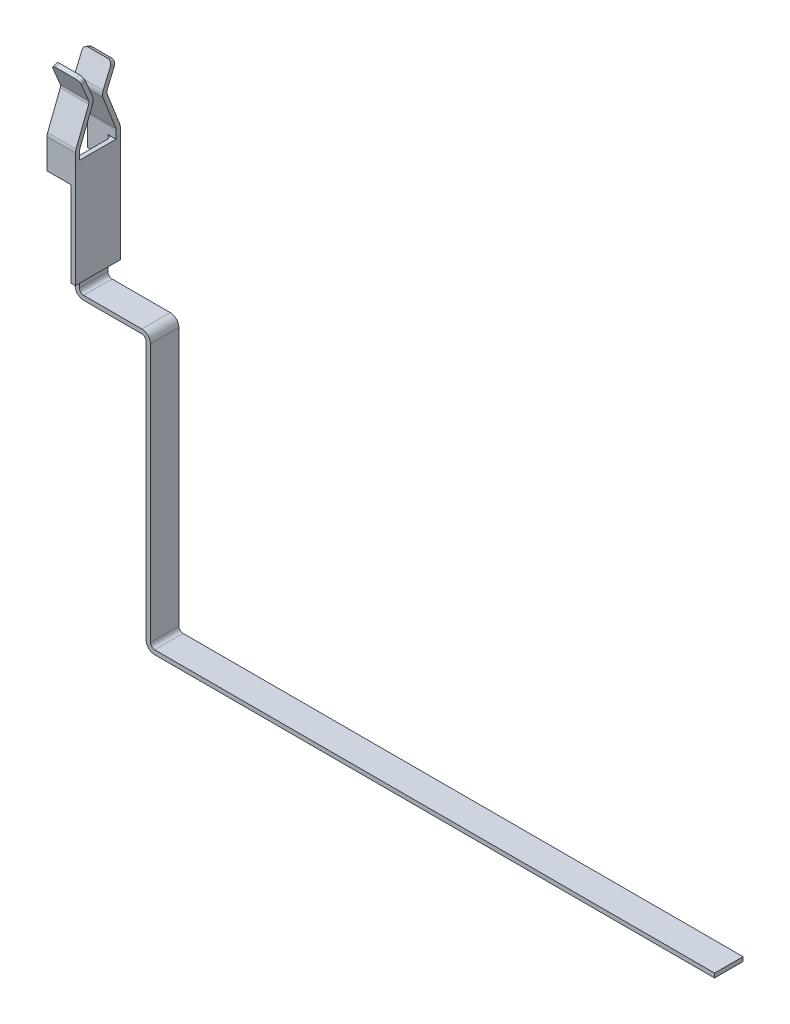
ISO-10303-21;
HEADER;
FILE_DESCRIPTION(('STEP AP214'),'2;1');
FILE_NAME('part.step','',(''),(''),'','','');
FILE_SCHEMA(('AUTOMOTIVE_DESIGN { 1 0 10303 214 1 1 1 1 }'));
ENDSEC;
DATA;
#1=APPLICATION_CONTEXT('core data for automotive mechanical design processes');
#2=APPLICATION_PROTOCOL_DEFINITION('international standard','automotive_design',2000,#1);
#3=PRODUCT_CONTEXT('',#1,'mechanical');
#4=PRODUCT('Part','Part','',(#3));
#5=PRODUCT_RELATED_PRODUCT_CATEGORY('part','',(#4));
#6=PRODUCT_DEFINITION_FORMATION('','',#4);
#7=PRODUCT_DEFINITION_CONTEXT('part definition',#1,'design');
#8=PRODUCT_DEFINITION('design','',#6,#7);
#9=PRODUCT_DEFINITION_SHAPE('','',#8);
#10=(LENGTH_UNIT() NAMED_UNIT(*) SI_UNIT(.MILLI.,.METRE.));
#11=(NAMED_UNIT(*) PLANE_ANGLE_UNIT() SI_UNIT($,.RADIAN.));
#12=(NAMED_UNIT(*) SI_UNIT($,.STERADIAN.) SOLID_ANGLE_UNIT());
#13=UNCERTAINTY_MEASURE_WITH_UNIT(LENGTH_MEASURE(1.E-05),#10,'distance_accuracy_value','');
#14=(GEOMETRIC_REPRESENTATION_CONTEXT(3) GLOBAL_UNCERTAINTY_ASSIGNED_CONTEXT((#13)) GLOBAL_UNIT_ASSIGNED_CONTEXT((#10,
#11,#12)) REPRESENTATION_CONTEXT('',''));
#15=CARTESIAN_POINT('',(0.,0.,0.));
#16=DIRECTION('',(0.,0.,1.));
#17=DIRECTION('',(1.,0.,0.));
#18=AXIS2_PLACEMENT_3D('',#15,#16,#17);
#19=CARTESIAN_POINT('',(6.731,-6.35,1.27));
#20=DIRECTION('',(1.,0.,0.));
#21=DIRECTION('',(0.,1.,0.));
#22=AXIS2_PLACEMENT_3D('',#19,#20,#21);
#23=PLANE('',#22);
#24=DIRECTION('',(0.,-1.,0.));
#25=VECTOR('',#24,1.);
#26=CARTESIAN_POINT('',(6.731,-6.35,1.27));
#27=LINE('',#26,#25);
#28=CARTESIAN_POINT('',(6.731,-6.731,1.27));
#29=VERTEX_POINT('',#28);
#30=CARTESIAN_POINT('',(6.731,-29.845,1.27));
#31=VERTEX_POINT('',#30);
#32=EDGE_CURVE('E514',#29,#31,#27,.T.);
#33=ORIENTED_EDGE('',*,*,#32,.T.);
#34=DIRECTION('',(0.,0.,-1.));
#35=VECTOR('',#34,1.);
#36=CARTESIAN_POINT('',(6.731,-29.845,1.27));
#37=LINE('',#36,#35);
#38=CARTESIAN_POINT('',(6.731,-29.845,-1.27));
#39=VERTEX_POINT('',#38);
#40=EDGE_CURVE('E732',#31,#39,#37,.T.);
#41=ORIENTED_EDGE('',*,*,#40,.T.);
#42=DIRECTION('',(0.,-1.,0.));
#43=VECTOR('',#42,1.);
#44=CARTESIAN_POINT('',(6.731,-6.35,-1.27));
#45=LINE('',#44,#43);
#46=CARTESIAN_POINT('',(6.731,-6.731,-1.27));
#47=VERTEX_POINT('',#46);
#48=EDGE_CURVE('E535',#47,#39,#45,.T.);
#49=ORIENTED_EDGE('',*,*,#48,.F.);
#50=DIRECTION('',(0.,0.,-1.));
#51=VECTOR('',#50,1.);
#52=CARTESIAN_POINT('',(6.731,-6.731,1.27));
#53=LINE('',#52,#51);
#54=EDGE_CURVE('E583',#47,#29,#53,.F.);
#55=ORIENTED_EDGE('',*,*,#54,.T.);
#56=EDGE_LOOP('',(#33,#41,#49,#55));
#57=FACE_BOUND('',#56,.T.);
#58=ADVANCED_FACE('F37',(#57),#23,.T.);
#59=CARTESIAN_POINT('',(0.380999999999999,4.674296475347,2.0066));
#60=DIRECTION('',(0.,1.,0.));
#61=DIRECTION('',(0.,0.,1.));
#62=AXIS2_PLACEMENT_3D('',#59,#60,#61);
#63=PLANE('',#62);
#64=DIRECTION('',(0.,0.,-1.));
#65=VECTOR('',#64,1.);
#66=CARTESIAN_POINT('',(0.761999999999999,4.674296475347,2.0066));
#67=LINE('',#66,#65);
#68=CARTESIAN_POINT('',(0.761999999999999,4.674296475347,1.6256));
#69=VERTEX_POINT('',#68);
#70=CARTESIAN_POINT('',(0.761999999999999,4.674296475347,-1.6256));
#71=VERTEX_POINT('',#70);
#72=EDGE_CURVE('E501',#69,#71,#67,.T.);
#73=ORIENTED_EDGE('',*,*,#72,.T.);
#74=DIRECTION('',(-1.,0.,0.));
#75=VECTOR('',#74,1.);
#76=CARTESIAN_POINT('',(0.380999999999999,4.674296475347,-1.6256));
#77=LINE('',#76,#75);
#78=CARTESIAN_POINT('',(0.,4.674296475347,-1.6256));
#79=VERTEX_POINT('',#78);
#80=EDGE_CURVE('E596',#71,#79,#77,.T.);
#81=ORIENTED_EDGE('',*,*,#80,.T.);
#82=CARTESIAN_POINT('',(0.,4.674296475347,-1.2446));
#83=DIRECTION('',(0.,1.,0.));
#84=DIRECTION('',(0.,0.,1.));
#85=AXIS2_PLACEMENT_3D('',#82,#83,#84);
#86=CIRCLE('',#85,0.381);
#87=CARTESIAN_POINT('',(0.380999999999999,4.674296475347,-1.2446));
#88=VERTEX_POINT('',#87);
#89=EDGE_CURVE('E609',#79,#88,#86,.F.);
#90=ORIENTED_EDGE('',*,*,#89,.T.);
#91=DIRECTION('',(0.,0.,-1.));
#92=VECTOR('',#91,1.);
#93=CARTESIAN_POINT('',(0.380999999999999,4.674296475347,2.0066));
#94=LINE('',#93,#92);
#95=CARTESIAN_POINT('',(0.380999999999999,4.674296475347,1.2446));
#96=VERTEX_POINT('',#95);
#97=EDGE_CURVE('E493',#96,#88,#94,.T.);
#98=ORIENTED_EDGE('',*,*,#97,.F.);
#99=CARTESIAN_POINT('',(0.,4.674296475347,1.2446));
#100=DIRECTION('',(0.,1.,0.));
#101=DIRECTION('',(0.,0.,1.));
#102=AXIS2_PLACEMENT_3D('',#99,#100,#101);
#103=CIRCLE('',#102,0.381);
#104=CARTESIAN_POINT('',(0.,4.674296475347,1.6256));
#105=VERTEX_POINT('',#104);
#106=EDGE_CURVE('E613',#96,#105,#103,.F.);
#107=ORIENTED_EDGE('',*,*,#106,.T.);
#108=DIRECTION('',(-1.,0.,0.));
#109=VECTOR('',#108,1.);
#110=CARTESIAN_POINT('',(0.380999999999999,4.674296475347,1.6256));
#111=LINE('',#110,#109);
#112=EDGE_CURVE('E594',#69,#105,#111,.T.);
#113=ORIENTED_EDGE('',*,*,#112,.F.);
#114=EDGE_LOOP('',(#73,#81,#90,#98,#107,#113));
#115=FACE_BOUND('',#114,.T.);
#116=ADVANCED_FACE('F765',(#115),#63,.T.);
#117=CARTESIAN_POINT('',(6.35,-6.35,1.27));
#118=DIRECTION('',(1.,0.,0.));
#119=DIRECTION('',(0.,1.,0.));
#120=AXIS2_PLACEMENT_3D('',#117,#118,#119);
#121=PLANE('',#120);
#122=DIRECTION('',(0.,-1.,0.));
#123=VECTOR('',#122,1.);
#124=CARTESIAN_POINT('',(6.35,-6.35,-1.27));
#125=LINE('',#124,#123);
#126=CARTESIAN_POINT('',(6.35,-6.731,-1.27));
#127=VERTEX_POINT('',#126);
#128=CARTESIAN_POINT('',(6.35,-29.845,-1.27));
#129=VERTEX_POINT('',#128);
#130=EDGE_CURVE('E510',#127,#129,#125,.T.);
#131=ORIENTED_EDGE('',*,*,#130,.T.);
#132=DIRECTION('',(0.,0.,1.));
#133=VECTOR('',#132,1.);
#134=CARTESIAN_POINT('',(6.35,-29.845,1.27));
#135=LINE('',#134,#133);
#136=CARTESIAN_POINT('',(6.35,-29.845,1.27));
#137=VERTEX_POINT('',#136);
#138=EDGE_CURVE('E740',#129,#137,#135,.T.);
#139=ORIENTED_EDGE('',*,*,#138,.T.);
#140=DIRECTION('',(0.,-1.,0.));
#141=VECTOR('',#140,1.);
#142=CARTESIAN_POINT('',(6.35,-6.35,1.27));
#143=LINE('',#142,#141);
#144=CARTESIAN_POINT('',(6.35,-6.731,1.27));
#145=VERTEX_POINT('',#144);
#146=EDGE_CURVE('E512',#145,#137,#143,.T.);
#147=ORIENTED_EDGE('',*,*,#146,.F.);
#148=DIRECTION('',(0.,0.,-1.));
#149=VECTOR('',#148,1.);
#150=CARTESIAN_POINT('',(6.35,-6.731,-1.27));
#151=LINE('',#150,#149);
#152=EDGE_CURVE('E555',#145,#127,#151,.T.);
#153=ORIENTED_EDGE('',*,*,#152,.T.);
#154=EDGE_LOOP('',(#131,#139,#147,#153));
#155=FACE_BOUND('',#154,.T.);
#156=ADVANCED_FACE('F746',(#155),#121,.F.);
#157=CARTESIAN_POINT('',(0.,-5.969,1.27));
#158=DIRECTION('',(0.,1.,0.));
#159=DIRECTION('',(0.,0.,1.));
#160=AXIS2_PLACEMENT_3D('',#157,#158,#159);
#161=PLANE('',#160);
#162=DIRECTION('',(1.,0.,0.));
#163=VECTOR('',#162,1.);
#164=CARTESIAN_POINT('',(0.,-5.969,1.27));
#165=LINE('',#164,#163);
#166=CARTESIAN_POINT('',(0.762,-5.969,1.27));
#167=VERTEX_POINT('',#166);
#168=CARTESIAN_POINT('',(5.969,-5.969,1.27));
#169=VERTEX_POINT('',#168);
#170=EDGE_CURVE('E518',#167,#169,#165,.T.);
#171=ORIENTED_EDGE('',*,*,#170,.T.);
#172=DIRECTION('',(0.,0.,-1.));
#173=VECTOR('',#172,1.);
#174=CARTESIAN_POINT('',(5.969,-5.969,1.27));
#175=LINE('',#174,#173);
#176=CARTESIAN_POINT('',(5.969,-5.969,-1.27));
#177=VERTEX_POINT('',#176);
#178=EDGE_CURVE('E576',#169,#177,#175,.T.);
#179=ORIENTED_EDGE('',*,*,#178,.T.);
#180=DIRECTION('',(1.,0.,0.));
#181=VECTOR('',#180,1.);
#182=CARTESIAN_POINT('',(0.,-5.969,-1.27));
#183=LINE('',#182,#181);
#184=CARTESIAN_POINT('',(0.762,-5.969,-1.27));
#185=VERTEX_POINT('',#184);
#186=EDGE_CURVE('E537',#185,#177,#183,.T.);
#187=ORIENTED_EDGE('',*,*,#186,.F.);
#188=DIRECTION('',(0.,0.,-1.));
#189=VECTOR('',#188,1.);
#190=CARTESIAN_POINT('',(0.762000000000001,-5.969,1.27));
#191=LINE('',#190,#189);
#192=EDGE_CURVE('E564',#185,#167,#191,.F.);
#193=ORIENTED_EDGE('',*,*,#192,.T.);
#194=EDGE_LOOP('',(#171,#179,#187,#193));
#195=FACE_BOUND('',#194,.T.);
#196=ADVANCED_FACE('F775',(#195),#161,.T.);
#197=CARTESIAN_POINT('',(0.381,0.,1.27));
#198=DIRECTION('',(1.,0.,0.));
#199=DIRECTION('',(0.,1.,0.));
#200=AXIS2_PLACEMENT_3D('',#197,#198,#199);
#201=PLANE('',#200);
#202=DIRECTION('',(0.,0.,-1.));
#203=VECTOR('',#202,1.);
#204=CARTESIAN_POINT('',(0.381,-4.850703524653,2.0066));
#205=LINE('',#204,#203);
#206=CARTESIAN_POINT('',(0.381,-4.850703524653,1.27));
#207=VERTEX_POINT('',#206);
#208=CARTESIAN_POINT('',(0.381000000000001,-4.850703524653,-1.27));
#209=VERTEX_POINT('',#208);
#210=EDGE_CURVE('E511',#207,#209,#205,.T.);
#211=ORIENTED_EDGE('',*,*,#210,.F.);
#212=DIRECTION('',(0.,-1.,0.));
#213=VECTOR('',#212,1.);
#214=CARTESIAN_POINT('',(0.381,0.,1.27));
#215=LINE('',#214,#213);
#216=CARTESIAN_POINT('',(0.381000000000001,-5.588,1.27));
#217=VERTEX_POINT('',#216);
#218=EDGE_CURVE('E521',#207,#217,#215,.T.);
#219=ORIENTED_EDGE('',*,*,#218,.T.);
#220=DIRECTION('',(0.,0.,-1.));
#221=VECTOR('',#220,1.);
#222=CARTESIAN_POINT('',(0.381000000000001,-5.588,-1.27));
#223=LINE('',#222,#221);
#224=CARTESIAN_POINT('',(0.381000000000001,-5.588,-1.27));
#225=VERTEX_POINT('',#224);
#226=EDGE_CURVE('E561',#217,#225,#223,.T.);
#227=ORIENTED_EDGE('',*,*,#226,.T.);
#228=DIRECTION('',(0.,-1.,0.));
#229=VECTOR('',#228,1.);
#230=CARTESIAN_POINT('',(0.381,0.,-1.27));
#231=LINE('',#230,#229);
#232=EDGE_CURVE('E540',#209,#225,#231,.T.);
#233=ORIENTED_EDGE('',*,*,#232,.F.);
#234=EDGE_LOOP('',(#211,#219,#227,#233));
#235=FACE_BOUND('',#234,.T.);
#236=ADVANCED_FACE('F924',(#235),#201,.T.);
#237=CARTESIAN_POINT('',(0.,0.,1.27));
#238=DIRECTION('',(0.,1.,0.));
#239=DIRECTION('',(-1.,0.,0.));
#240=AXIS2_PLACEMENT_3D('',#237,#238,#239);
#241=PLANE('',#240);
#242=DIRECTION('',(1.,0.,0.));
#243=VECTOR('',#242,1.);
#244=CARTESIAN_POINT('',(0.,0.,-1.27));
#245=LINE('',#244,#243);
#246=CARTESIAN_POINT('',(0.,0.,-1.27));
#247=VERTEX_POINT('',#246);
#248=CARTESIAN_POINT('',(0.381,0.,-1.27));
#249=VERTEX_POINT('',#248);
#250=EDGE_CURVE('E544',#247,#249,#245,.T.);
#251=ORIENTED_EDGE('',*,*,#250,.F.);
#252=DIRECTION('',(0.,0.,-1.));
#253=VECTOR('',#252,1.);
#254=CARTESIAN_POINT('',(0.,0.,1.27));
#255=LINE('',#254,#253);
#256=CARTESIAN_POINT('',(0.,0.,1.27));
#257=VERTEX_POINT('',#256);
#258=EDGE_CURVE('E532',#257,#247,#255,.T.);
#259=ORIENTED_EDGE('',*,*,#258,.F.);
#260=DIRECTION('',(1.,0.,0.));
#261=VECTOR('',#260,1.);
#262=CARTESIAN_POINT('',(0.,0.,1.27));
#263=LINE('',#262,#261);
#264=CARTESIAN_POINT('',(0.381,0.,1.27));
#265=VERTEX_POINT('',#264);
#266=EDGE_CURVE('E524',#257,#265,#263,.T.);
#267=ORIENTED_EDGE('',*,*,#266,.T.);
#268=DIRECTION('',(0.,0.,-1.));
#269=VECTOR('',#268,1.);
#270=CARTESIAN_POINT('',(0.381,0.,1.27));
#271=LINE('',#270,#269);
#272=EDGE_CURVE('E552',#265,#249,#271,.T.);
#273=ORIENTED_EDGE('',*,*,#272,.T.);
#274=EDGE_LOOP('',(#251,#259,#267,#273));
#275=FACE_BOUND('',#274,.T.);
#276=ADVANCED_FACE('F945',(#275),#241,.T.);
#277=CARTESIAN_POINT('',(0.,0.,1.27));
#278=DIRECTION('',(1.,0.,0.));
#279=DIRECTION('',(0.,1.,0.));
#280=AXIS2_PLACEMENT_3D('',#277,#278,#279);
#281=PLANE('',#280);
#282=DIRECTION('',(0.,-1.,0.));
#283=VECTOR('',#282,1.);
#284=CARTESIAN_POINT('',(0.,0.,-1.27));
#285=LINE('',#284,#283);
#286=CARTESIAN_POINT('',(0.,-5.588,-1.27));
#287=VERTEX_POINT('',#286);
#288=EDGE_CURVE('E547',#247,#287,#285,.T.);
#289=ORIENTED_EDGE('',*,*,#288,.T.);
#290=DIRECTION('',(0.,0.,-1.));
#291=VECTOR('',#290,1.);
#292=CARTESIAN_POINT('',(0.,-5.588,1.27));
#293=LINE('',#292,#291);
#294=CARTESIAN_POINT('',(0.,-5.588,1.27));
#295=VERTEX_POINT('',#294);
#296=EDGE_CURVE('E592',#287,#295,#293,.F.);
#297=ORIENTED_EDGE('',*,*,#296,.T.);
#298=DIRECTION('',(0.,-1.,0.));
#299=VECTOR('',#298,1.);
#300=CARTESIAN_POINT('',(0.,0.,1.27));
#301=LINE('',#300,#299);
#302=EDGE_CURVE('E527',#257,#295,#301,.T.);
#303=ORIENTED_EDGE('',*,*,#302,.F.);
#304=ORIENTED_EDGE('',*,*,#258,.T.);
#305=EDGE_LOOP('',(#289,#297,#303,#304));
#306=FACE_BOUND('',#305,.T.);
#307=ADVANCED_FACE('F949',(#306),#281,.F.);
#308=CARTESIAN_POINT('',(0.,-6.35,1.27));
#309=DIRECTION('',(0.,1.,0.));
#310=DIRECTION('',(0.,0.,1.));
#311=AXIS2_PLACEMENT_3D('',#308,#309,#310);
#312=PLANE('',#311);
#313=DIRECTION('',(1.,0.,0.));
#314=VECTOR('',#313,1.);
#315=CARTESIAN_POINT('',(0.,-6.35,1.27));
#316=LINE('',#315,#314);
#317=CARTESIAN_POINT('',(0.762000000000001,-6.35,1.27));
#318=VERTEX_POINT('',#317);
#319=CARTESIAN_POINT('',(5.969,-6.35,1.27));
#320=VERTEX_POINT('',#319);
#321=EDGE_CURVE('E530',#318,#320,#316,.T.);
#322=ORIENTED_EDGE('',*,*,#321,.F.);
#323=DIRECTION('',(0.,0.,-1.));
#324=VECTOR('',#323,1.);
#325=CARTESIAN_POINT('',(0.762000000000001,-6.35,1.27));
#326=LINE('',#325,#324);
#327=CARTESIAN_POINT('',(0.762000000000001,-6.35,-1.27));
#328=VERTEX_POINT('',#327);
#329=EDGE_CURVE('E589',#318,#328,#326,.T.);
#330=ORIENTED_EDGE('',*,*,#329,.T.);
#331=DIRECTION('',(1.,0.,0.));
#332=VECTOR('',#331,1.);
#333=CARTESIAN_POINT('',(0.,-6.35,-1.27));
#334=LINE('',#333,#332);
#335=CARTESIAN_POINT('',(5.969,-6.35,-1.27));
#336=VERTEX_POINT('',#335);
#337=EDGE_CURVE('E515',#328,#336,#334,.T.);
#338=ORIENTED_EDGE('',*,*,#337,.T.);
#339=DIRECTION('',(0.,0.,-1.));
#340=VECTOR('',#339,1.);
#341=CARTESIAN_POINT('',(5.969,-6.35,1.27));
#342=LINE('',#341,#340);
#343=EDGE_CURVE('E558',#336,#320,#342,.F.);
#344=ORIENTED_EDGE('',*,*,#343,.T.);
#345=EDGE_LOOP('',(#322,#330,#338,#344));
#346=FACE_BOUND('',#345,.T.);
#347=ADVANCED_FACE('F955',(#346),#312,.F.);
#348=CARTESIAN_POINT('',(0.,0.,1.27));
#349=DIRECTION('',(0.,0.,-1.));
#350=DIRECTION('',(-1.,0.,0.));
#351=AXIS2_PLACEMENT_3D('',#348,#349,#350);
#352=PLANE('',#351);
#353=ORIENTED_EDGE('',*,*,#146,.T.);
#354=CARTESIAN_POINT('',(7.112,-29.845,1.27));
#355=DIRECTION('',(0.,0.,-1.));
#356=DIRECTION('',(-1.,0.,0.));
#357=AXIS2_PLACEMENT_3D('',#354,#355,#356);
#358=CIRCLE('',#357,0.762);
#359=CARTESIAN_POINT('',(7.112,-30.607,1.27));
#360=VERTEX_POINT('',#359);
#361=EDGE_CURVE('E59',#137,#360,#358,.F.);
#362=ORIENTED_EDGE('',*,*,#361,.T.);
#363=DIRECTION('',(-1.,0.,0.));
#364=VECTOR('',#363,1.);
#365=CARTESIAN_POINT('',(6.35,-30.607,1.27));
#366=LINE('',#365,#364);
#367=CARTESIAN_POINT('',(57.15,-30.607,1.27));
#368=VERTEX_POINT('',#367);
#369=EDGE_CURVE('E382',#368,#360,#366,.T.);
#370=ORIENTED_EDGE('',*,*,#369,.F.);
#371=DIRECTION('',(0.,-1.,0.));
#372=VECTOR('',#371,1.);
#373=CARTESIAN_POINT('',(57.15,-30.226,1.27));
#374=LINE('',#373,#372);
#375=CARTESIAN_POINT('',(57.15,-30.226,1.27));
#376=VERTEX_POINT('',#375);
#377=EDGE_CURVE('E367',#376,#368,#374,.T.);
#378=ORIENTED_EDGE('',*,*,#377,.F.);
#379=DIRECTION('',(1.,0.,0.));
#380=VECTOR('',#379,1.);
#381=CARTESIAN_POINT('',(6.35,-30.226,1.27));
#382=LINE('',#381,#380);
#383=CARTESIAN_POINT('',(7.112,-30.226,1.27));
#384=VERTEX_POINT('',#383);
#385=EDGE_CURVE('E373',#384,#376,#382,.T.);
#386=ORIENTED_EDGE('',*,*,#385,.F.);
#387=CARTESIAN_POINT('',(7.112,-29.845,1.27));
#388=DIRECTION('',(0.,0.,-1.));
#389=DIRECTION('',(-1.,0.,0.));
#390=AXIS2_PLACEMENT_3D('',#387,#388,#389);
#391=CIRCLE('',#390,0.381);
#392=EDGE_CURVE('E738',#384,#31,#391,.T.);
#393=ORIENTED_EDGE('',*,*,#392,.T.);
#394=ORIENTED_EDGE('',*,*,#32,.F.);
#395=CARTESIAN_POINT('',(5.969,-6.731,1.27));
#396=DIRECTION('',(0.,0.,-1.));
#397=DIRECTION('',(-1.,0.,0.));
#398=AXIS2_PLACEMENT_3D('',#395,#396,#397);
#399=CIRCLE('',#398,0.762);
#400=EDGE_CURVE('E587',#29,#169,#399,.F.);
#401=ORIENTED_EDGE('',*,*,#400,.T.);
#402=ORIENTED_EDGE('',*,*,#170,.F.);
#403=CARTESIAN_POINT('',(0.762000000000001,-5.588,1.27));
#404=DIRECTION('',(0.,0.,-1.));
#405=DIRECTION('',(-1.,0.,0.));
#406=AXIS2_PLACEMENT_3D('',#403,#404,#405);
#407=CIRCLE('',#406,0.381);
#408=EDGE_CURVE('E573',#167,#217,#407,.T.);
#409=ORIENTED_EDGE('',*,*,#408,.T.);
#410=ORIENTED_EDGE('',*,*,#218,.F.);
#411=EDGE_CURVE('E522',#265,#207,#215,.T.);
#412=ORIENTED_EDGE('',*,*,#411,.F.);
#413=ORIENTED_EDGE('',*,*,#266,.F.);
#414=ORIENTED_EDGE('',*,*,#302,.T.);
#415=CARTESIAN_POINT('',(0.762000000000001,-5.588,1.27));
#416=DIRECTION('',(0.,0.,-1.));
#417=DIRECTION('',(-1.,0.,0.));
#418=AXIS2_PLACEMENT_3D('',#415,#416,#417);
#419=CIRCLE('',#418,0.762);
#420=EDGE_CURVE('E585',#295,#318,#419,.F.);
#421=ORIENTED_EDGE('',*,*,#420,.T.);
#422=ORIENTED_EDGE('',*,*,#321,.T.);
#423=CARTESIAN_POINT('',(5.969,-6.731,1.27));
#424=DIRECTION('',(0.,0.,-1.));
#425=DIRECTION('',(-1.,0.,0.));
#426=AXIS2_PLACEMENT_3D('',#423,#424,#425);
#427=CIRCLE('',#426,0.381);
#428=EDGE_CURVE('E569',#320,#145,#427,.T.);
#429=ORIENTED_EDGE('',*,*,#428,.T.);
#430=EDGE_LOOP('',(#353,#362,#370,#378,#386,#393,#394,#401,#402,#409,#410,#412,#413,#414,#421,
#422,#429));
#431=FACE_BOUND('',#430,.T.);
#432=ADVANCED_FACE('F751',(#431),#352,.F.);
#433=CARTESIAN_POINT('',(0.,0.,-1.27));
#434=DIRECTION('',(0.,0.,-1.));
#435=DIRECTION('',(-1.,0.,0.));
#436=AXIS2_PLACEMENT_3D('',#433,#434,#435);
#437=PLANE('',#436);
#438=DIRECTION('',(1.,0.,0.));
#439=VECTOR('',#438,1.);
#440=CARTESIAN_POINT('',(0.,-30.607,-1.27));
#441=LINE('',#440,#439);
#442=CARTESIAN_POINT('',(7.112,-30.607,-1.27));
#443=VERTEX_POINT('',#442);
#444=CARTESIAN_POINT('',(57.15,-30.607,-1.27));
#445=VERTEX_POINT('',#444);
#446=EDGE_CURVE('E730',#443,#445,#441,.T.);
#447=ORIENTED_EDGE('',*,*,#446,.F.);
#448=CARTESIAN_POINT('',(7.112,-29.845,-1.27));
#449=DIRECTION('',(0.,0.,-1.));
#450=DIRECTION('',(-1.,0.,0.));
#451=AXIS2_PLACEMENT_3D('',#448,#449,#450);
#452=CIRCLE('',#451,0.762);
#453=EDGE_CURVE('E11',#443,#129,#452,.T.);
#454=ORIENTED_EDGE('',*,*,#453,.T.);
#455=ORIENTED_EDGE('',*,*,#130,.F.);
#456=CARTESIAN_POINT('',(5.969,-6.731,-1.27));
#457=DIRECTION('',(0.,0.,-1.));
#458=DIRECTION('',(-1.,0.,0.));
#459=AXIS2_PLACEMENT_3D('',#456,#457,#458);
#460=CIRCLE('',#459,0.381);
#461=EDGE_CURVE('E566',#127,#336,#460,.F.);
#462=ORIENTED_EDGE('',*,*,#461,.T.);
#463=ORIENTED_EDGE('',*,*,#337,.F.);
#464=CARTESIAN_POINT('',(0.762000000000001,-5.588,-1.27));
#465=DIRECTION('',(0.,0.,-1.));
#466=DIRECTION('',(-1.,0.,0.));
#467=AXIS2_PLACEMENT_3D('',#464,#465,#466);
#468=CIRCLE('',#467,0.762);
#469=EDGE_CURVE('E579',#328,#287,#468,.T.);
#470=ORIENTED_EDGE('',*,*,#469,.T.);
#471=ORIENTED_EDGE('',*,*,#288,.F.);
#472=ORIENTED_EDGE('',*,*,#250,.T.);
#473=EDGE_CURVE('E541',#249,#209,#231,.T.);
#474=ORIENTED_EDGE('',*,*,#473,.T.);
#475=ORIENTED_EDGE('',*,*,#232,.T.);
#476=CARTESIAN_POINT('',(0.762000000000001,-5.588,-1.27));
#477=DIRECTION('',(0.,0.,-1.));
#478=DIRECTION('',(-1.,0.,0.));
#479=AXIS2_PLACEMENT_3D('',#476,#477,#478);
#480=CIRCLE('',#479,0.381);
#481=EDGE_CURVE('E571',#225,#185,#480,.F.);
#482=ORIENTED_EDGE('',*,*,#481,.T.);
#483=ORIENTED_EDGE('',*,*,#186,.T.);
#484=CARTESIAN_POINT('',(5.969,-6.731,-1.27));
#485=DIRECTION('',(0.,0.,-1.));
#486=DIRECTION('',(-1.,0.,0.));
#487=AXIS2_PLACEMENT_3D('',#484,#485,#486);
#488=CIRCLE('',#487,0.762);
#489=EDGE_CURVE('E581',#177,#47,#488,.T.);
#490=ORIENTED_EDGE('',*,*,#489,.T.);
#491=ORIENTED_EDGE('',*,*,#48,.T.);
#492=CARTESIAN_POINT('',(7.112,-29.845,-1.27));
#493=DIRECTION('',(0.,0.,-1.));
#494=DIRECTION('',(-1.,0.,0.));
#495=AXIS2_PLACEMENT_3D('',#492,#493,#494);
#496=CIRCLE('',#495,0.381);
#497=CARTESIAN_POINT('',(7.112,-30.226,-1.27));
#498=VERTEX_POINT('',#497);
#499=EDGE_CURVE('E364',#39,#498,#496,.F.);
#500=ORIENTED_EDGE('',*,*,#499,.T.);
#501=DIRECTION('',(1.,0.,0.));
#502=VECTOR('',#501,1.);
#503=CARTESIAN_POINT('',(6.35,-30.226,-1.27));
#504=LINE('',#503,#502);
#505=CARTESIAN_POINT('',(57.15,-30.226,-1.27));
#506=VERTEX_POINT('',#505);
#507=EDGE_CURVE('E358',#498,#506,#504,.T.);
#508=ORIENTED_EDGE('',*,*,#507,.T.);
#509=DIRECTION('',(0.,-1.,0.));
#510=VECTOR('',#509,1.);
#511=CARTESIAN_POINT('',(57.15,-30.226,-1.27));
#512=LINE('',#511,#510);
#513=EDGE_CURVE('E362',#506,#445,#512,.T.);
#514=ORIENTED_EDGE('',*,*,#513,.T.);
#515=EDGE_LOOP('',(#447,#454,#455,#462,#463,#470,#471,#472,#474,#475,#482,#483,#490,#491,#500,
#508,#514));
#516=FACE_BOUND('',#515,.T.);
#517=ADVANCED_FACE('F360',(#516),#437,.T.);
#518=CARTESIAN_POINT('',(5.969,-6.731,1.27));
#519=DIRECTION('',(0.,0.,1.));
#520=DIRECTION('',(1.,0.,0.));
#521=AXIS2_PLACEMENT_3D('',#518,#519,#520);
#522=CYLINDRICAL_SURFACE('',#521,0.381);
#523=ORIENTED_EDGE('',*,*,#428,.F.);
#524=ORIENTED_EDGE('',*,*,#343,.F.);
#525=ORIENTED_EDGE('',*,*,#461,.F.);
#526=ORIENTED_EDGE('',*,*,#152,.F.);
#527=EDGE_LOOP('',(#523,#524,#525,#526));
#528=FACE_BOUND('',#527,.T.);
#529=ADVANCED_FACE('F756',(#528),#522,.F.);
#530=CARTESIAN_POINT('',(0.762000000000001,-5.588,1.27));
#531=DIRECTION('',(0.,0.,1.));
#532=DIRECTION('',(1.,0.,0.));
#533=AXIS2_PLACEMENT_3D('',#530,#531,#532);
#534=CYLINDRICAL_SURFACE('',#533,0.381);
#535=ORIENTED_EDGE('',*,*,#408,.F.);
#536=ORIENTED_EDGE('',*,*,#192,.F.);
#537=ORIENTED_EDGE('',*,*,#481,.F.);
#538=ORIENTED_EDGE('',*,*,#226,.F.);
#539=EDGE_LOOP('',(#535,#536,#537,#538));
#540=FACE_BOUND('',#539,.T.);
#541=ADVANCED_FACE('F781',(#540),#534,.F.);
#542=CARTESIAN_POINT('',(5.969,-6.731,1.27));
#543=DIRECTION('',(0.,0.,-1.));
#544=DIRECTION('',(-1.,0.,0.));
#545=AXIS2_PLACEMENT_3D('',#542,#543,#544);
#546=CYLINDRICAL_SURFACE('',#545,0.762);
#547=ORIENTED_EDGE('',*,*,#400,.F.);
#548=ORIENTED_EDGE('',*,*,#54,.F.);
#549=ORIENTED_EDGE('',*,*,#489,.F.);
#550=ORIENTED_EDGE('',*,*,#178,.F.);
#551=EDGE_LOOP('',(#547,#548,#549,#550));
#552=FACE_BOUND('',#551,.T.);
#553=ADVANCED_FACE('F784',(#552),#546,.T.);
#554=CARTESIAN_POINT('',(0.762000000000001,-5.588,1.27));
#555=DIRECTION('',(0.,0.,-1.));
#556=DIRECTION('',(-1.,0.,0.));
#557=AXIS2_PLACEMENT_3D('',#554,#555,#556);
#558=CYLINDRICAL_SURFACE('',#557,0.762);
#559=ORIENTED_EDGE('',*,*,#420,.F.);
#560=ORIENTED_EDGE('',*,*,#296,.F.);
#561=ORIENTED_EDGE('',*,*,#469,.F.);
#562=ORIENTED_EDGE('',*,*,#329,.F.);
#563=EDGE_LOOP('',(#559,#560,#561,#562));
#564=FACE_BOUND('',#563,.T.);
#565=ADVANCED_FACE('F788',(#564),#558,.T.);
#566=CARTESIAN_POINT('',(0.380999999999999,4.674296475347,2.0066));
#567=DIRECTION('',(1.,0.,0.));
#568=DIRECTION('',(0.,1.,0.));
#569=AXIS2_PLACEMENT_3D('',#566,#567,#568);
#570=PLANE('',#569);
#571=ORIENTED_EDGE('',*,*,#97,.T.);
#572=DIRECTION('',(0.,1.,0.));
#573=VECTOR('',#572,1.);
#574=CARTESIAN_POINT('',(0.380999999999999,2.769296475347,-1.2446));
#575=LINE('',#574,#573);
#576=CARTESIAN_POINT('',(0.380999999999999,2.769296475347,-1.2446));
#577=VERTEX_POINT('',#576);
#578=EDGE_CURVE('E604',#88,#577,#575,.F.);
#579=ORIENTED_EDGE('',*,*,#578,.T.);
#580=DIRECTION('',(0.,0.,-1.));
#581=VECTOR('',#580,1.);
#582=CARTESIAN_POINT('',(0.380999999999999,2.769296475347,2.0066));
#583=LINE('',#582,#581);
#584=CARTESIAN_POINT('',(0.380999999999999,2.769296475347,-2.0066));
#585=VERTEX_POINT('',#584);
#586=EDGE_CURVE('E426',#577,#585,#583,.T.);
#587=ORIENTED_EDGE('',*,*,#586,.T.);
#588=DIRECTION('',(0.,-1.,0.));
#589=VECTOR('',#588,1.);
#590=CARTESIAN_POINT('',(0.380999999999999,4.674296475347,-2.0066));
#591=LINE('',#590,#589);
#592=CARTESIAN_POINT('',(0.381,-4.850703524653,-2.0066));
#593=VERTEX_POINT('',#592);
#594=EDGE_CURVE('E484',#585,#593,#591,.T.);
#595=ORIENTED_EDGE('',*,*,#594,.T.);
#596=EDGE_CURVE('E506',#209,#593,#205,.T.);
#597=ORIENTED_EDGE('',*,*,#596,.F.);
#598=ORIENTED_EDGE('',*,*,#473,.F.);
#599=ORIENTED_EDGE('',*,*,#272,.F.);
#600=ORIENTED_EDGE('',*,*,#411,.T.);
#601=CARTESIAN_POINT('',(0.381,-4.850703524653,2.0066));
#602=VERTEX_POINT('',#601);
#603=EDGE_CURVE('E507',#602,#207,#205,.T.);
#604=ORIENTED_EDGE('',*,*,#603,.F.);
#605=DIRECTION('',(0.,-1.,0.));
#606=VECTOR('',#605,1.);
#607=CARTESIAN_POINT('',(0.380999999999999,4.674296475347,2.0066));
#608=LINE('',#607,#606);
#609=CARTESIAN_POINT('',(0.380999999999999,2.769296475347,2.0066));
#610=VERTEX_POINT('',#609);
#611=EDGE_CURVE('E485',#610,#602,#608,.T.);
#612=ORIENTED_EDGE('',*,*,#611,.F.);
#613=DIRECTION('',(0.,0.,1.));
#614=VECTOR('',#613,1.);
#615=CARTESIAN_POINT('',(0.380999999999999,2.769296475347,2.0066));
#616=LINE('',#615,#614);
#617=CARTESIAN_POINT('',(0.380999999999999,2.769296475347,1.2446));
#618=VERTEX_POINT('',#617);
#619=EDGE_CURVE('E473',#618,#610,#616,.T.);
#620=ORIENTED_EDGE('',*,*,#619,.F.);
#621=DIRECTION('',(0.,1.,0.));
#622=VECTOR('',#621,1.);
#623=CARTESIAN_POINT('',(0.380999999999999,4.674296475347,1.2446));
#624=LINE('',#623,#622);
#625=EDGE_CURVE('E601',#618,#96,#624,.T.);
#626=ORIENTED_EDGE('',*,*,#625,.T.);
#627=EDGE_LOOP('',(#571,#579,#587,#595,#597,#598,#599,#600,#604,#612,#620,#626));
#628=FACE_BOUND('',#627,.T.);
#629=ADVANCED_FACE('F792',(#628),#570,.F.);
#630=CARTESIAN_POINT('',(0.762,-4.850703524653,2.0066));
#631=DIRECTION('',(0.,-1.,0.));
#632=DIRECTION('',(0.,0.,-1.));
#633=AXIS2_PLACEMENT_3D('',#630,#631,#632);
#634=PLANE('',#633);
#635=DIRECTION('',(-1.,0.,0.));
#636=VECTOR('',#635,1.);
#637=CARTESIAN_POINT('',(0.762,-4.850703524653,-2.0066));
#638=LINE('',#637,#636);
#639=CARTESIAN_POINT('',(0.762,-4.850703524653,-2.0066));
#640=VERTEX_POINT('',#639);
#641=EDGE_CURVE('E495',#640,#593,#638,.T.);
#642=ORIENTED_EDGE('',*,*,#641,.F.);
#643=DIRECTION('',(0.,0.,-1.));
#644=VECTOR('',#643,1.);
#645=CARTESIAN_POINT('',(0.762,-4.850703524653,2.0066));
#646=LINE('',#645,#644);
#647=CARTESIAN_POINT('',(0.762,-4.850703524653,2.0066));
#648=VERTEX_POINT('',#647);
#649=EDGE_CURVE('E503',#648,#640,#646,.T.);
#650=ORIENTED_EDGE('',*,*,#649,.F.);
#651=DIRECTION('',(-1.,0.,0.));
#652=VECTOR('',#651,1.);
#653=CARTESIAN_POINT('',(0.762,-4.850703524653,2.0066));
#654=LINE('',#653,#652);
#655=EDGE_CURVE('E487',#648,#602,#654,.T.);
#656=ORIENTED_EDGE('',*,*,#655,.T.);
#657=ORIENTED_EDGE('',*,*,#603,.T.);
#658=ORIENTED_EDGE('',*,*,#210,.T.);
#659=ORIENTED_EDGE('',*,*,#596,.T.);
#660=EDGE_LOOP('',(#642,#650,#656,#657,#658,#659));
#661=FACE_BOUND('',#660,.T.);
#662=ADVANCED_FACE('F914',(#661),#634,.T.);
#663=CARTESIAN_POINT('',(0.761999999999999,4.674296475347,2.0066));
#664=DIRECTION('',(1.,0.,0.));
#665=DIRECTION('',(0.,1.,0.));
#666=AXIS2_PLACEMENT_3D('',#663,#664,#665);
#667=PLANE('',#666);
#668=DIRECTION('',(0.,0.921851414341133,0.387543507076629));
#669=VECTOR('',#668,1.);
#670=CARTESIAN_POINT('',(0.761999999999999,8.8859505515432,0.413489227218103));
#671=LINE('',#670,#669);
#672=CARTESIAN_POINT('',(0.761999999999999,9.0284414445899,0.473391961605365));
#673=VERTEX_POINT('',#672);
#674=CARTESIAN_POINT('',(0.761999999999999,10.5667251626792,1.12008171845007));
#675=VERTEX_POINT('',#674);
#676=EDGE_CURVE('E436',#673,#675,#671,.T.);
#677=ORIENTED_EDGE('',*,*,#676,.T.);
#678=DIRECTION('',(0.,0.387543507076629,-0.921851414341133));
#679=VECTOR('',#678,1.);
#680=CARTESIAN_POINT('',(0.761999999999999,10.419071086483,1.47130710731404));
#681=LINE('',#680,#679);
#682=CARTESIAN_POINT('',(0.761999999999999,10.419071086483,1.47130710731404));
#683=VERTEX_POINT('',#682);
#684=EDGE_CURVE('E706',#675,#683,#681,.F.);
#685=ORIENTED_EDGE('',*,*,#684,.T.);
#686=DIRECTION('',(0.,0.921851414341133,0.387543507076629));
#687=VECTOR('',#686,1.);
#688=CARTESIAN_POINT('',(0.761999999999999,8.738296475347,0.764714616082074));
#689=LINE('',#688,#687);
#690=CARTESIAN_POINT('',(0.761999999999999,8.8807873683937,0.824617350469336));
#691=VERTEX_POINT('',#690);
#692=EDGE_CURVE('E460',#691,#683,#689,.T.);
#693=ORIENTED_EDGE('',*,*,#692,.F.);
#694=CARTESIAN_POINT('',(0.761999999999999,8.7331332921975,1.17584273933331));
#695=DIRECTION('',(1.,0.,0.));
#696=DIRECTION('',(0.,1.,0.));
#697=AXIS2_PLACEMENT_3D('',#694,#695,#696);
#698=CIRCLE('',#697,0.381);
#699=CARTESIAN_POINT('',(0.761999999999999,8.59434617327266,0.821020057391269));
#700=VERTEX_POINT('',#699);
#701=EDGE_CURVE('E653',#691,#700,#698,.F.);
#702=ORIENTED_EDGE('',*,*,#701,.T.);
#703=DIRECTION('',(0.,0.931293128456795,-0.364270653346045));
#704=VECTOR('',#703,1.);
#705=CARTESIAN_POINT('',(0.761999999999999,5.563296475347,2.0066));
#706=LINE('',#705,#704);
#707=CARTESIAN_POINT('',(0.761999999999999,5.69714616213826,1.95424536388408));
#708=VERTEX_POINT('',#707);
#709=EDGE_CURVE('E463',#708,#700,#706,.T.);
#710=ORIENTED_EDGE('',*,*,#709,.F.);
#711=CARTESIAN_POINT('',(0.761999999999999,5.41957192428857,1.2446));
#712=DIRECTION('',(1.,0.,0.));
#713=DIRECTION('',(0.,1.,0.));
#714=AXIS2_PLACEMENT_3D('',#711,#712,#713);
#715=CIRCLE('',#714,0.762);
#716=CARTESIAN_POINT('',(0.761999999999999,5.41957192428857,2.0066));
#717=VERTEX_POINT('',#716);
#718=EDGE_CURVE('E665',#708,#717,#715,.T.);
#719=ORIENTED_EDGE('',*,*,#718,.T.);
#720=DIRECTION('',(0.,-1.,0.));
#721=VECTOR('',#720,1.);
#722=CARTESIAN_POINT('',(0.761999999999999,4.674296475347,2.0066));
#723=LINE('',#722,#721);
#724=EDGE_CURVE('E491',#717,#648,#723,.T.);
#725=ORIENTED_EDGE('',*,*,#724,.T.);
#726=ORIENTED_EDGE('',*,*,#649,.T.);
#727=DIRECTION('',(0.,-1.,0.));
#728=VECTOR('',#727,1.);
#729=CARTESIAN_POINT('',(0.761999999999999,4.674296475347,-2.0066));
#730=LINE('',#729,#728);
#731=CARTESIAN_POINT('',(0.761999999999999,5.41957192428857,-2.0066));
#732=VERTEX_POINT('',#731);
#733=EDGE_CURVE('E488',#732,#640,#730,.T.);
#734=ORIENTED_EDGE('',*,*,#733,.F.);
#735=CARTESIAN_POINT('',(0.761999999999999,5.41957192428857,-1.2446));
#736=DIRECTION('',(1.,0.,0.));
#737=DIRECTION('',(0.,1.,0.));
#738=AXIS2_PLACEMENT_3D('',#735,#736,#737);
#739=CIRCLE('',#738,0.762);
#740=CARTESIAN_POINT('',(0.761999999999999,5.69714616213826,-1.95424536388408));
#741=VERTEX_POINT('',#740);
#742=EDGE_CURVE('E667',#732,#741,#739,.T.);
#743=ORIENTED_EDGE('',*,*,#742,.T.);
#744=DIRECTION('',(0.,0.931293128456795,0.364270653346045));
#745=VECTOR('',#744,1.);
#746=CARTESIAN_POINT('',(0.761999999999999,5.563296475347,-2.0066));
#747=LINE('',#746,#745);
#748=CARTESIAN_POINT('',(0.761999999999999,8.59434617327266,-0.821020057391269));
#749=VERTEX_POINT('',#748);
#750=EDGE_CURVE('E419',#741,#749,#747,.T.);
#751=ORIENTED_EDGE('',*,*,#750,.T.);
#752=CARTESIAN_POINT('',(0.761999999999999,8.7331332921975,-1.17584273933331));
#753=DIRECTION('',(1.,0.,0.));
#754=DIRECTION('',(0.,1.,0.));
#755=AXIS2_PLACEMENT_3D('',#752,#753,#754);
#756=CIRCLE('',#755,0.381);
#757=CARTESIAN_POINT('',(0.761999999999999,8.8807873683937,-0.824617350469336));
#758=VERTEX_POINT('',#757);
#759=EDGE_CURVE('E644',#749,#758,#756,.F.);
#760=ORIENTED_EDGE('',*,*,#759,.T.);
#761=DIRECTION('',(0.,0.921851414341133,-0.387543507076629));
#762=VECTOR('',#761,1.);
#763=CARTESIAN_POINT('',(0.761999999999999,8.738296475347,-0.764714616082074));
#764=LINE('',#763,#762);
#765=CARTESIAN_POINT('',(0.761999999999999,10.419071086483,-1.47130710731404));
#766=VERTEX_POINT('',#765);
#767=EDGE_CURVE('E393',#758,#766,#764,.T.);
#768=ORIENTED_EDGE('',*,*,#767,.T.);
#769=DIRECTION('',(0.,0.387543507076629,0.921851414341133));
#770=VECTOR('',#769,1.);
#771=CARTESIAN_POINT('',(0.761999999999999,10.7987720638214,-0.568110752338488));
#772=LINE('',#771,#770);
#773=CARTESIAN_POINT('',(0.761999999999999,10.5667251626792,-1.12008171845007));
#774=VERTEX_POINT('',#773);
#775=EDGE_CURVE('E703',#766,#774,#772,.T.);
#776=ORIENTED_EDGE('',*,*,#775,.T.);
#777=DIRECTION('',(0.,0.921851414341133,-0.387543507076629));
#778=VECTOR('',#777,1.);
#779=CARTESIAN_POINT('',(0.761999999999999,8.8859505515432,-0.413489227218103));
#780=LINE('',#779,#778);
#781=CARTESIAN_POINT('',(0.761999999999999,9.0284414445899,-0.473391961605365));
#782=VERTEX_POINT('',#781);
#783=EDGE_CURVE('E384',#782,#774,#780,.T.);
#784=ORIENTED_EDGE('',*,*,#783,.F.);
#785=CARTESIAN_POINT('',(0.761999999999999,8.7331332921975,-1.17584273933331));
#786=DIRECTION('',(1.,0.,0.));
#787=DIRECTION('',(0.,1.,0.));
#788=AXIS2_PLACEMENT_3D('',#785,#786,#787);
#789=CIRCLE('',#788,0.762);
#790=CARTESIAN_POINT('',(0.761999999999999,8.45555905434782,-0.46619737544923));
#791=VERTEX_POINT('',#790);
#792=EDGE_CURVE('E663',#782,#791,#789,.T.);
#793=ORIENTED_EDGE('',*,*,#792,.T.);
#794=DIRECTION('',(0.,0.931293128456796,0.364270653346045));
#795=VECTOR('',#794,1.);
#796=CARTESIAN_POINT('',(0.761999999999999,5.42450935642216,-1.65177731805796));
#797=LINE('',#796,#795);
#798=CARTESIAN_POINT('',(0.761999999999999,5.55835904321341,-1.59942268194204));
#799=VERTEX_POINT('',#798);
#800=EDGE_CURVE('E413',#799,#791,#797,.T.);
#801=ORIENTED_EDGE('',*,*,#800,.F.);
#802=CARTESIAN_POINT('',(0.761999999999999,5.41957192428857,-1.2446));
#803=DIRECTION('',(1.,0.,0.));
#804=DIRECTION('',(0.,1.,0.));
#805=AXIS2_PLACEMENT_3D('',#802,#803,#804);
#806=CIRCLE('',#805,0.381);
#807=CARTESIAN_POINT('',(0.761999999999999,5.41957192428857,-1.6256));
#808=VERTEX_POINT('',#807);
#809=EDGE_CURVE('E649',#799,#808,#806,.F.);
#810=ORIENTED_EDGE('',*,*,#809,.T.);
#811=DIRECTION('',(0.,1.,0.));
#812=VECTOR('',#811,1.);
#813=CARTESIAN_POINT('',(0.761999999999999,2.769296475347,-1.6256));
#814=LINE('',#813,#812);
#815=EDGE_CURVE('E416',#71,#808,#814,.T.);
#816=ORIENTED_EDGE('',*,*,#815,.F.);
#817=ORIENTED_EDGE('',*,*,#72,.F.);
#818=DIRECTION('',(0.,1.,0.));
#819=VECTOR('',#818,1.);
#820=CARTESIAN_POINT('',(0.761999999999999,2.769296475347,1.6256));
#821=LINE('',#820,#819);
#822=CARTESIAN_POINT('',(0.761999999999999,5.41957192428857,1.6256));
#823=VERTEX_POINT('',#822);
#824=EDGE_CURVE('E465',#69,#823,#821,.T.);
#825=ORIENTED_EDGE('',*,*,#824,.T.);
#826=CARTESIAN_POINT('',(0.761999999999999,5.41957192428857,1.2446));
#827=DIRECTION('',(1.,0.,0.));
#828=DIRECTION('',(0.,1.,0.));
#829=AXIS2_PLACEMENT_3D('',#826,#827,#828);
#830=CIRCLE('',#829,0.381);
#831=CARTESIAN_POINT('',(0.761999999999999,5.55835904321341,1.59942268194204));
#832=VERTEX_POINT('',#831);
#833=EDGE_CURVE('E640',#823,#832,#830,.F.);
#834=ORIENTED_EDGE('',*,*,#833,.T.);
#835=DIRECTION('',(0.,0.931293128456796,-0.364270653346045));
#836=VECTOR('',#835,1.);
#837=CARTESIAN_POINT('',(0.761999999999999,5.42450935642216,1.65177731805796));
#838=LINE('',#837,#836);
#839=CARTESIAN_POINT('',(0.761999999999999,8.45555905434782,0.46619737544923));
#840=VERTEX_POINT('',#839);
#841=EDGE_CURVE('E441',#832,#840,#838,.T.);
#842=ORIENTED_EDGE('',*,*,#841,.T.);
#843=CARTESIAN_POINT('',(0.761999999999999,8.7331332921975,1.17584273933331));
#844=DIRECTION('',(1.,0.,0.));
#845=DIRECTION('',(0.,1.,0.));
#846=AXIS2_PLACEMENT_3D('',#843,#844,#845);
#847=CIRCLE('',#846,0.762);
#848=EDGE_CURVE('E661',#840,#673,#847,.T.);
#849=ORIENTED_EDGE('',*,*,#848,.T.);
#850=EDGE_LOOP('',(#677,#685,#693,#702,#710,#719,#725,#726,#734,#743,#751,#760,#768,#776,#784,
#793,#801,#810,#816,#817,#825,#834,#842,#849));
#851=FACE_BOUND('',#850,.T.);
#852=ADVANCED_FACE('F872',(#851),#667,.T.);
#853=CARTESIAN_POINT('',(0.,0.,2.0066));
#854=DIRECTION('',(0.,0.,-1.));
#855=DIRECTION('',(-1.,0.,0.));
#856=AXIS2_PLACEMENT_3D('',#853,#854,#855);
#857=PLANE('',#856);
#858=ORIENTED_EDGE('',*,*,#724,.F.);
#859=DIRECTION('',(1.,0.,0.));
#860=VECTOR('',#859,1.);
#861=CARTESIAN_POINT('',(0.,5.41957192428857,2.0066));
#862=LINE('',#861,#860);
#863=CARTESIAN_POINT('',(-1.778,5.41957192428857,2.0066));
#864=VERTEX_POINT('',#863);
#865=EDGE_CURVE('E678',#717,#864,#862,.F.);
#866=ORIENTED_EDGE('',*,*,#865,.T.);
#867=DIRECTION('',(0.,1.,0.));
#868=VECTOR('',#867,1.);
#869=CARTESIAN_POINT('',(-1.778,2.769296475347,2.0066));
#870=LINE('',#869,#868);
#871=CARTESIAN_POINT('',(-1.778,2.769296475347,2.0066));
#872=VERTEX_POINT('',#871);
#873=EDGE_CURVE('E446',#872,#864,#870,.T.);
#874=ORIENTED_EDGE('',*,*,#873,.F.);
#875=DIRECTION('',(1.,0.,0.));
#876=VECTOR('',#875,1.);
#877=CARTESIAN_POINT('',(-1.778,2.769296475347,2.0066));
#878=LINE('',#877,#876);
#879=EDGE_CURVE('E474',#872,#610,#878,.T.);
#880=ORIENTED_EDGE('',*,*,#879,.T.);
#881=ORIENTED_EDGE('',*,*,#611,.T.);
#882=ORIENTED_EDGE('',*,*,#655,.F.);
#883=EDGE_LOOP('',(#858,#866,#874,#880,#881,#882));
#884=FACE_BOUND('',#883,.T.);
#885=ADVANCED_FACE('F904',(#884),#857,.F.);
#886=CARTESIAN_POINT('',(0.,0.,-2.0066));
#887=DIRECTION('',(0.,0.,-1.));
#888=DIRECTION('',(-1.,0.,0.));
#889=AXIS2_PLACEMENT_3D('',#886,#887,#888);
#890=PLANE('',#889);
#891=DIRECTION('',(0.,1.,0.));
#892=VECTOR('',#891,1.);
#893=CARTESIAN_POINT('',(-1.778,2.769296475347,-2.0066));
#894=LINE('',#893,#892);
#895=CARTESIAN_POINT('',(-1.778,2.769296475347,-2.0066));
#896=VERTEX_POINT('',#895);
#897=CARTESIAN_POINT('',(-1.778,5.41957192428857,-2.0066));
#898=VERTEX_POINT('',#897);
#899=EDGE_CURVE('E402',#896,#898,#894,.T.);
#900=ORIENTED_EDGE('',*,*,#899,.T.);
#901=DIRECTION('',(1.,0.,0.));
#902=VECTOR('',#901,1.);
#903=CARTESIAN_POINT('',(0.,5.41957192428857,-2.0066));
#904=LINE('',#903,#902);
#905=EDGE_CURVE('E658',#898,#732,#904,.T.);
#906=ORIENTED_EDGE('',*,*,#905,.T.);
#907=ORIENTED_EDGE('',*,*,#733,.T.);
#908=ORIENTED_EDGE('',*,*,#641,.T.);
#909=ORIENTED_EDGE('',*,*,#594,.F.);
#910=DIRECTION('',(1.,0.,0.));
#911=VECTOR('',#910,1.);
#912=CARTESIAN_POINT('',(-1.778,2.769296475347,-2.0066));
#913=LINE('',#912,#911);
#914=EDGE_CURVE('E430',#896,#585,#913,.T.);
#915=ORIENTED_EDGE('',*,*,#914,.F.);
#916=EDGE_LOOP('',(#900,#906,#907,#908,#909,#915));
#917=FACE_BOUND('',#916,.T.);
#918=ADVANCED_FACE('F970',(#917),#890,.T.);
#919=CARTESIAN_POINT('',(-1.778,2.769296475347,1.6256));
#920=DIRECTION('',(0.,0.,-1.));
#921=DIRECTION('',(-1.,0.,0.));
#922=AXIS2_PLACEMENT_3D('',#919,#920,#921);
#923=PLANE('',#922);
#924=DIRECTION('',(0.,1.,0.));
#925=VECTOR('',#924,1.);
#926=CARTESIAN_POINT('',(-1.778,2.769296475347,1.6256));
#927=LINE('',#926,#925);
#928=CARTESIAN_POINT('',(-1.778,2.769296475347,1.6256));
#929=VERTEX_POINT('',#928);
#930=CARTESIAN_POINT('',(-1.778,5.41957192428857,1.6256));
#931=VERTEX_POINT('',#930);
#932=EDGE_CURVE('E451',#929,#931,#927,.T.);
#933=ORIENTED_EDGE('',*,*,#932,.T.);
#934=DIRECTION('',(1.,0.,0.));
#935=VECTOR('',#934,1.);
#936=CARTESIAN_POINT('',(0.761999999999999,5.41957192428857,1.6256));
#937=LINE('',#936,#935);
#938=EDGE_CURVE('E619',#931,#823,#937,.T.);
#939=ORIENTED_EDGE('',*,*,#938,.T.);
#940=ORIENTED_EDGE('',*,*,#824,.F.);
#941=ORIENTED_EDGE('',*,*,#112,.T.);
#942=DIRECTION('',(0.,1.,0.));
#943=VECTOR('',#942,1.);
#944=CARTESIAN_POINT('',(0.,2.769296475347,1.6256));
#945=LINE('',#944,#943);
#946=CARTESIAN_POINT('',(0.,2.769296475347,1.6256));
#947=VERTEX_POINT('',#946);
#948=EDGE_CURVE('E607',#105,#947,#945,.F.);
#949=ORIENTED_EDGE('',*,*,#948,.T.);
#950=DIRECTION('',(1.,0.,0.));
#951=VECTOR('',#950,1.);
#952=CARTESIAN_POINT('',(-1.778,2.769296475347,1.6256));
#953=LINE('',#952,#951);
#954=EDGE_CURVE('E470',#929,#947,#953,.T.);
#955=ORIENTED_EDGE('',*,*,#954,.F.);
#956=EDGE_LOOP('',(#933,#939,#940,#941,#949,#955));
#957=FACE_BOUND('',#956,.T.);
#958=ADVANCED_FACE('F894',(#957),#923,.T.);
#959=CARTESIAN_POINT('',(-1.778,2.769296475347,1.6256));
#960=DIRECTION('',(0.,1.,0.));
#961=DIRECTION('',(-1.,0.,0.));
#962=AXIS2_PLACEMENT_3D('',#959,#960,#961);
#963=PLANE('',#962);
#964=ORIENTED_EDGE('',*,*,#954,.T.);
#965=CARTESIAN_POINT('',(0.,2.769296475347,1.2446));
#966=DIRECTION('',(0.,1.,0.));
#967=DIRECTION('',(-1.,0.,0.));
#968=AXIS2_PLACEMENT_3D('',#965,#966,#967);
#969=CIRCLE('',#968,0.381);
#970=EDGE_CURVE('E616',#947,#618,#969,.T.);
#971=ORIENTED_EDGE('',*,*,#970,.T.);
#972=ORIENTED_EDGE('',*,*,#619,.T.);
#973=ORIENTED_EDGE('',*,*,#879,.F.);
#974=DIRECTION('',(0.,0.,1.));
#975=VECTOR('',#974,1.);
#976=CARTESIAN_POINT('',(-1.778,2.769296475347,1.6256));
#977=LINE('',#976,#975);
#978=EDGE_CURVE('E449',#929,#872,#977,.T.);
#979=ORIENTED_EDGE('',*,*,#978,.F.);
#980=EDGE_LOOP('',(#964,#971,#972,#973,#979));
#981=FACE_BOUND('',#980,.T.);
#982=ADVANCED_FACE('F901',(#981),#963,.F.);
#983=CARTESIAN_POINT('',(-1.778,8.8859505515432,0.413489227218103));
#984=DIRECTION('',(0.,0.387543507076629,-0.921851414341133));
#985=DIRECTION('',(0.,0.921851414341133,0.387543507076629));
#986=AXIS2_PLACEMENT_3D('',#983,#984,#985);
#987=PLANE('',#986);
#988=DIRECTION('',(1.,0.,0.));
#989=VECTOR('',#988,1.);
#990=CARTESIAN_POINT('',(-1.778,10.9179505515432,1.26773579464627));
#991=LINE('',#990,#989);
#992=CARTESIAN_POINT('',(-1.397,10.9179505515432,1.26773579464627));
#993=VERTEX_POINT('',#992);
#994=CARTESIAN_POINT('',(0.380999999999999,10.9179505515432,1.26773579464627));
#995=VERTEX_POINT('',#994);
#996=EDGE_CURVE('E457',#993,#995,#991,.T.);
#997=ORIENTED_EDGE('',*,*,#996,.T.);
#998=CARTESIAN_POINT('',(0.380999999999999,10.5667251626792,1.12008171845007));
#999=DIRECTION('',(0.,0.387543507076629,-0.921851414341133));
#1000=DIRECTION('',(0.,0.921851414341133,0.387543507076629));
#1001=AXIS2_PLACEMENT_3D('',#998,#999,#1000);
#1002=CIRCLE('',#1001,0.381);
#1003=EDGE_CURVE('E701',#995,#675,#1002,.T.);
#1004=ORIENTED_EDGE('',*,*,#1003,.T.);
#1005=ORIENTED_EDGE('',*,*,#676,.F.);
#1006=DIRECTION('',(1.,0.,0.));
#1007=VECTOR('',#1006,1.);
#1008=CARTESIAN_POINT('',(-1.778,9.0284414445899,0.473391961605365));
#1009=LINE('',#1008,#1007);
#1010=CARTESIAN_POINT('',(-1.778,9.0284414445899,0.473391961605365));
#1011=VERTEX_POINT('',#1010);
#1012=EDGE_CURVE('E692',#673,#1011,#1009,.F.);
#1013=ORIENTED_EDGE('',*,*,#1012,.T.);
#1014=DIRECTION('',(0.,0.921851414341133,0.387543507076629));
#1015=VECTOR('',#1014,1.);
#1016=CARTESIAN_POINT('',(-1.778,8.8859505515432,0.413489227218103));
#1017=LINE('',#1016,#1015);
#1018=CARTESIAN_POINT('',(-1.778,10.5667251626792,1.12008171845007));
#1019=VERTEX_POINT('',#1018);
#1020=EDGE_CURVE('E437',#1011,#1019,#1017,.T.);
#1021=ORIENTED_EDGE('',*,*,#1020,.T.);
#1022=CARTESIAN_POINT('',(-1.397,10.5667251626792,1.12008171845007));
#1023=DIRECTION('',(0.,0.387543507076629,-0.921851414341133));
#1024=DIRECTION('',(0.,0.921851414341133,0.387543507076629));
#1025=AXIS2_PLACEMENT_3D('',#1022,#1023,#1024);
#1026=CIRCLE('',#1025,0.381);
#1027=EDGE_CURVE('E699',#1019,#993,#1026,.T.);
#1028=ORIENTED_EDGE('',*,*,#1027,.T.);
#1029=EDGE_LOOP('',(#997,#1004,#1005,#1013,#1021,#1028));
#1030=FACE_BOUND('',#1029,.T.);
#1031=ADVANCED_FACE('F881',(#1030),#987,.T.);
#1032=CARTESIAN_POINT('',(-1.778,5.42450935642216,1.65177731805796));
#1033=DIRECTION('',(0.,-0.364270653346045,-0.931293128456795));
#1034=DIRECTION('',(0.,0.931293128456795,-0.364270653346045));
#1035=AXIS2_PLACEMENT_3D('',#1032,#1033,#1034);
#1036=PLANE('',#1035);
#1037=DIRECTION('',(0.,0.931293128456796,-0.364270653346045));
#1038=VECTOR('',#1037,1.);
#1039=CARTESIAN_POINT('',(-1.778,5.42450935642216,1.65177731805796));
#1040=LINE('',#1039,#1038);
#1041=CARTESIAN_POINT('',(-1.778,5.55835904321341,1.59942268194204));
#1042=VERTEX_POINT('',#1041);
#1043=CARTESIAN_POINT('',(-1.778,8.45555905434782,0.46619737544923));
#1044=VERTEX_POINT('',#1043);
#1045=EDGE_CURVE('E454',#1042,#1044,#1040,.T.);
#1046=ORIENTED_EDGE('',*,*,#1045,.T.);
#1047=DIRECTION('',(1.,0.,0.));
#1048=VECTOR('',#1047,1.);
#1049=CARTESIAN_POINT('',(-1.778,8.45555905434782,0.46619737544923));
#1050=LINE('',#1049,#1048);
#1051=EDGE_CURVE('E689',#1044,#840,#1050,.T.);
#1052=ORIENTED_EDGE('',*,*,#1051,.T.);
#1053=ORIENTED_EDGE('',*,*,#841,.F.);
#1054=DIRECTION('',(1.,0.,0.));
#1055=VECTOR('',#1054,1.);
#1056=CARTESIAN_POINT('',(-1.778,5.55835904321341,1.59942268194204));
#1057=LINE('',#1056,#1055);
#1058=EDGE_CURVE('E622',#832,#1042,#1057,.F.);
#1059=ORIENTED_EDGE('',*,*,#1058,.T.);
#1060=EDGE_LOOP('',(#1046,#1052,#1053,#1059));
#1061=FACE_BOUND('',#1060,.T.);
#1062=ADVANCED_FACE('F888',(#1061),#1036,.T.);
#1063=CARTESIAN_POINT('',(-1.778,5.563296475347,2.0066));
#1064=DIRECTION('',(0.,-0.364270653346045,-0.931293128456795));
#1065=DIRECTION('',(0.,0.931293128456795,-0.364270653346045));
#1066=AXIS2_PLACEMENT_3D('',#1063,#1064,#1065);
#1067=PLANE('',#1066);
#1068=DIRECTION('',(0.,0.931293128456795,-0.364270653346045));
#1069=VECTOR('',#1068,1.);
#1070=CARTESIAN_POINT('',(-1.778,5.563296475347,2.0066));
#1071=LINE('',#1070,#1069);
#1072=CARTESIAN_POINT('',(-1.778,5.69714616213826,1.95424536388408));
#1073=VERTEX_POINT('',#1072);
#1074=CARTESIAN_POINT('',(-1.778,8.59434617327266,0.821020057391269));
#1075=VERTEX_POINT('',#1074);
#1076=EDGE_CURVE('E444',#1073,#1075,#1071,.T.);
#1077=ORIENTED_EDGE('',*,*,#1076,.F.);
#1078=DIRECTION('',(1.,0.,0.));
#1079=VECTOR('',#1078,1.);
#1080=CARTESIAN_POINT('',(-1.778,5.69714616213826,1.95424536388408));
#1081=LINE('',#1080,#1079);
#1082=EDGE_CURVE('E675',#1073,#708,#1081,.T.);
#1083=ORIENTED_EDGE('',*,*,#1082,.T.);
#1084=ORIENTED_EDGE('',*,*,#709,.T.);
#1085=DIRECTION('',(1.,0.,0.));
#1086=VECTOR('',#1085,1.);
#1087=CARTESIAN_POINT('',(-1.778,8.59434617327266,0.821020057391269));
#1088=LINE('',#1087,#1086);
#1089=EDGE_CURVE('E637',#700,#1075,#1088,.F.);
#1090=ORIENTED_EDGE('',*,*,#1089,.T.);
#1091=EDGE_LOOP('',(#1077,#1083,#1084,#1090));
#1092=FACE_BOUND('',#1091,.T.);
#1093=ADVANCED_FACE('F909',(#1092),#1067,.F.);
#1094=CARTESIAN_POINT('',(-1.778,8.738296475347,0.764714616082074));
#1095=DIRECTION('',(0.,0.387543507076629,-0.921851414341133));
#1096=DIRECTION('',(0.,0.921851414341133,0.387543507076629));
#1097=AXIS2_PLACEMENT_3D('',#1094,#1095,#1096);
#1098=PLANE('',#1097);
#1099=ORIENTED_EDGE('',*,*,#692,.T.);
#1100=CARTESIAN_POINT('',(0.380999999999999,10.419071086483,1.47130710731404));
#1101=DIRECTION('',(0.,0.387543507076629,-0.921851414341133));
#1102=DIRECTION('',(0.,0.921851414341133,0.387543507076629));
#1103=AXIS2_PLACEMENT_3D('',#1100,#1101,#1102);
#1104=CIRCLE('',#1103,0.381);
#1105=CARTESIAN_POINT('',(0.380999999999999,10.770296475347,1.61896118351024));
#1106=VERTEX_POINT('',#1105);
#1107=EDGE_CURVE('E710',#683,#1106,#1104,.F.);
#1108=ORIENTED_EDGE('',*,*,#1107,.T.);
#1109=DIRECTION('',(1.,0.,0.));
#1110=VECTOR('',#1109,1.);
#1111=CARTESIAN_POINT('',(-1.778,10.770296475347,1.61896118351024));
#1112=LINE('',#1111,#1110);
#1113=CARTESIAN_POINT('',(-1.397,10.770296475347,1.61896118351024));
#1114=VERTEX_POINT('',#1113);
#1115=EDGE_CURVE('E477',#1114,#1106,#1112,.T.);
#1116=ORIENTED_EDGE('',*,*,#1115,.F.);
#1117=CARTESIAN_POINT('',(-1.397,10.419071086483,1.47130710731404));
#1118=DIRECTION('',(0.,0.387543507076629,-0.921851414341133));
#1119=DIRECTION('',(0.,0.921851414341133,0.387543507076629));
#1120=AXIS2_PLACEMENT_3D('',#1117,#1118,#1119);
#1121=CIRCLE('',#1120,0.381);
#1122=CARTESIAN_POINT('',(-1.778,10.419071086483,1.47130710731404));
#1123=VERTEX_POINT('',#1122);
#1124=EDGE_CURVE('E708',#1114,#1123,#1121,.F.);
#1125=ORIENTED_EDGE('',*,*,#1124,.T.);
#1126=DIRECTION('',(0.,0.921851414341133,0.387543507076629));
#1127=VECTOR('',#1126,1.);
#1128=CARTESIAN_POINT('',(-1.778,8.738296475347,0.764714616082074));
#1129=LINE('',#1128,#1127);
#1130=CARTESIAN_POINT('',(-1.778,8.8807873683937,0.824617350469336));
#1131=VERTEX_POINT('',#1130);
#1132=EDGE_CURVE('E440',#1131,#1123,#1129,.T.);
#1133=ORIENTED_EDGE('',*,*,#1132,.F.);
#1134=DIRECTION('',(1.,0.,0.));
#1135=VECTOR('',#1134,1.);
#1136=CARTESIAN_POINT('',(0.761999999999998,8.8807873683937,0.824617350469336));
#1137=LINE('',#1136,#1135);
#1138=EDGE_CURVE('E634',#1131,#691,#1137,.T.);
#1139=ORIENTED_EDGE('',*,*,#1138,.T.);
#1140=EDGE_LOOP('',(#1099,#1108,#1116,#1125,#1133,#1139));
#1141=FACE_BOUND('',#1140,.T.);
#1142=ADVANCED_FACE('F861',(#1141),#1098,.F.);
#1143=CARTESIAN_POINT('',(-1.778,10.770296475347,1.61896118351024));
#1144=DIRECTION('',(0.,-0.921851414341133,-0.387543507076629));
#1145=DIRECTION('',(0.,0.387543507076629,-0.921851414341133));
#1146=AXIS2_PLACEMENT_3D('',#1143,#1144,#1145);
#1147=PLANE('',#1146);
#1148=ORIENTED_EDGE('',*,*,#1115,.T.);
#1149=DIRECTION('',(0.,0.387543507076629,-0.921851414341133));
#1150=VECTOR('',#1149,1.);
#1151=CARTESIAN_POINT('',(0.380999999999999,10.9179505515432,1.26773579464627));
#1152=LINE('',#1151,#1150);
#1153=EDGE_CURVE('E696',#1106,#995,#1152,.T.);
#1154=ORIENTED_EDGE('',*,*,#1153,.T.);
#1155=ORIENTED_EDGE('',*,*,#996,.F.);
#1156=DIRECTION('',(0.,0.387543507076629,-0.921851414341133));
#1157=VECTOR('',#1156,1.);
#1158=CARTESIAN_POINT('',(-1.397,10.770296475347,1.61896118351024));
#1159=LINE('',#1158,#1157);
#1160=EDGE_CURVE('E694',#993,#1114,#1159,.F.);
#1161=ORIENTED_EDGE('',*,*,#1160,.T.);
#1162=EDGE_LOOP('',(#1148,#1154,#1155,#1161));
#1163=FACE_BOUND('',#1162,.T.);
#1164=ADVANCED_FACE('F878',(#1163),#1147,.F.);
#1165=CARTESIAN_POINT('',(-1.778,0.,0.));
#1166=DIRECTION('',(-1.,0.,0.));
#1167=DIRECTION('',(0.,0.,1.));
#1168=AXIS2_PLACEMENT_3D('',#1165,#1166,#1167);
#1169=PLANE('',#1168);
#1170=ORIENTED_EDGE('',*,*,#1132,.T.);
#1171=DIRECTION('',(0.,0.387543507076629,-0.921851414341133));
#1172=VECTOR('',#1171,1.);
#1173=CARTESIAN_POINT('',(-1.778,10.5667251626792,1.12008171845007));
#1174=LINE('',#1173,#1172);
#1175=EDGE_CURVE('E727',#1123,#1019,#1174,.T.);
#1176=ORIENTED_EDGE('',*,*,#1175,.T.);
#1177=ORIENTED_EDGE('',*,*,#1020,.F.);
#1178=CARTESIAN_POINT('',(-1.778,8.7331332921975,1.17584273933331));
#1179=DIRECTION('',(-1.,0.,0.));
#1180=DIRECTION('',(0.,-1.,0.));
#1181=AXIS2_PLACEMENT_3D('',#1178,#1179,#1180);
#1182=CIRCLE('',#1181,0.762);
#1183=EDGE_CURVE('E680',#1011,#1044,#1182,.T.);
#1184=ORIENTED_EDGE('',*,*,#1183,.T.);
#1185=ORIENTED_EDGE('',*,*,#1045,.F.);
#1186=CARTESIAN_POINT('',(-1.778,5.41957192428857,1.2446));
#1187=DIRECTION('',(-1.,0.,0.));
#1188=DIRECTION('',(0.,-1.,0.));
#1189=AXIS2_PLACEMENT_3D('',#1186,#1187,#1188);
#1190=CIRCLE('',#1189,0.381);
#1191=EDGE_CURVE('E642',#1042,#931,#1190,.F.);
#1192=ORIENTED_EDGE('',*,*,#1191,.T.);
#1193=ORIENTED_EDGE('',*,*,#932,.F.);
#1194=ORIENTED_EDGE('',*,*,#978,.T.);
#1195=ORIENTED_EDGE('',*,*,#873,.T.);
#1196=CARTESIAN_POINT('',(-1.778,5.41957192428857,1.2446));
#1197=DIRECTION('',(-1.,0.,0.));
#1198=DIRECTION('',(0.,-1.,0.));
#1199=AXIS2_PLACEMENT_3D('',#1196,#1197,#1198);
#1200=CIRCLE('',#1199,0.762);
#1201=EDGE_CURVE('E682',#864,#1073,#1200,.T.);
#1202=ORIENTED_EDGE('',*,*,#1201,.T.);
#1203=ORIENTED_EDGE('',*,*,#1076,.T.);
#1204=CARTESIAN_POINT('',(-1.778,8.7331332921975,1.17584273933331));
#1205=DIRECTION('',(-1.,0.,0.));
#1206=DIRECTION('',(0.,-1.,0.));
#1207=AXIS2_PLACEMENT_3D('',#1204,#1205,#1206);
#1208=CIRCLE('',#1207,0.381);
#1209=EDGE_CURVE('E656',#1075,#1131,#1208,.F.);
#1210=ORIENTED_EDGE('',*,*,#1209,.T.);
#1211=EDGE_LOOP('',(#1170,#1176,#1177,#1184,#1185,#1192,#1193,#1194,#1195,#1202,#1203,#1210));
#1212=FACE_BOUND('',#1211,.T.);
#1213=ADVANCED_FACE('F864',(#1212),#1169,.T.);
#1214=CARTESIAN_POINT('',(-1.778,2.769296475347,-1.6256));
#1215=DIRECTION('',(0.,0.,-1.));
#1216=DIRECTION('',(-1.,0.,0.));
#1217=AXIS2_PLACEMENT_3D('',#1214,#1215,#1216);
#1218=PLANE('',#1217);
#1219=ORIENTED_EDGE('',*,*,#815,.T.);
#1220=DIRECTION('',(1.,0.,0.));
#1221=VECTOR('',#1220,1.);
#1222=CARTESIAN_POINT('',(-1.778,5.41957192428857,-1.6256));
#1223=LINE('',#1222,#1221);
#1224=CARTESIAN_POINT('',(-1.778,5.41957192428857,-1.6256));
#1225=VERTEX_POINT('',#1224);
#1226=EDGE_CURVE('E632',#808,#1225,#1223,.F.);
#1227=ORIENTED_EDGE('',*,*,#1226,.T.);
#1228=DIRECTION('',(0.,1.,0.));
#1229=VECTOR('',#1228,1.);
#1230=CARTESIAN_POINT('',(-1.778,2.769296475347,-1.6256));
#1231=LINE('',#1230,#1229);
#1232=CARTESIAN_POINT('',(-1.778,2.769296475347,-1.6256));
#1233=VERTEX_POINT('',#1232);
#1234=EDGE_CURVE('E396',#1233,#1225,#1231,.T.);
#1235=ORIENTED_EDGE('',*,*,#1234,.F.);
#1236=DIRECTION('',(1.,0.,0.));
#1237=VECTOR('',#1236,1.);
#1238=CARTESIAN_POINT('',(-1.778,2.769296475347,-1.6256));
#1239=LINE('',#1238,#1237);
#1240=CARTESIAN_POINT('',(0.,2.769296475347,-1.6256));
#1241=VERTEX_POINT('',#1240);
#1242=EDGE_CURVE('E410',#1233,#1241,#1239,.T.);
#1243=ORIENTED_EDGE('',*,*,#1242,.T.);
#1244=DIRECTION('',(0.,1.,0.));
#1245=VECTOR('',#1244,1.);
#1246=CARTESIAN_POINT('',(0.,4.674296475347,-1.6256));
#1247=LINE('',#1246,#1245);
#1248=EDGE_CURVE('E598',#1241,#79,#1247,.T.);
#1249=ORIENTED_EDGE('',*,*,#1248,.T.);
#1250=ORIENTED_EDGE('',*,*,#80,.F.);
#1251=EDGE_LOOP('',(#1219,#1227,#1235,#1243,#1249,#1250));
#1252=FACE_BOUND('',#1251,.T.);
#1253=ADVANCED_FACE('F992',(#1252),#1218,.F.);
#1254=CARTESIAN_POINT('',(-1.778,2.769296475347,-1.6256));
#1255=DIRECTION('',(0.,-1.,0.));
#1256=DIRECTION('',(1.,0.,0.));
#1257=AXIS2_PLACEMENT_3D('',#1254,#1255,#1256);
#1258=PLANE('',#1257);
#1259=ORIENTED_EDGE('',*,*,#586,.F.);
#1260=CARTESIAN_POINT('',(0.,2.769296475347,-1.2446));
#1261=DIRECTION('',(0.,-1.,0.));
#1262=DIRECTION('',(1.,0.,0.));
#1263=AXIS2_PLACEMENT_3D('',#1260,#1261,#1262);
#1264=CIRCLE('',#1263,0.381);
#1265=EDGE_CURVE('E611',#577,#1241,#1264,.F.);
#1266=ORIENTED_EDGE('',*,*,#1265,.T.);
#1267=ORIENTED_EDGE('',*,*,#1242,.F.);
#1268=DIRECTION('',(0.,0.,-1.));
#1269=VECTOR('',#1268,1.);
#1270=CARTESIAN_POINT('',(-1.778,2.769296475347,-1.6256));
#1271=LINE('',#1270,#1269);
#1272=EDGE_CURVE('E399',#1233,#896,#1271,.T.);
#1273=ORIENTED_EDGE('',*,*,#1272,.T.);
#1274=ORIENTED_EDGE('',*,*,#914,.T.);
#1275=EDGE_LOOP('',(#1259,#1266,#1267,#1273,#1274));
#1276=FACE_BOUND('',#1275,.T.);
#1277=ADVANCED_FACE('F997',(#1276),#1258,.T.);
#1278=CARTESIAN_POINT('',(-1.778,8.8859505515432,-0.413489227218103));
#1279=DIRECTION('',(0.,-0.387543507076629,-0.921851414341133));
#1280=DIRECTION('',(0.,0.921851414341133,-0.387543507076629));
#1281=AXIS2_PLACEMENT_3D('',#1278,#1279,#1280);
#1282=PLANE('',#1281);
#1283=ORIENTED_EDGE('',*,*,#783,.T.);
#1284=CARTESIAN_POINT('',(0.380999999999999,10.5667251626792,-1.12008171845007));
#1285=DIRECTION('',(0.,-0.387543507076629,-0.921851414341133));
#1286=DIRECTION('',(0.,0.921851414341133,-0.387543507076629));
#1287=AXIS2_PLACEMENT_3D('',#1284,#1285,#1286);
#1288=CIRCLE('',#1287,0.381);
#1289=CARTESIAN_POINT('',(0.380999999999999,10.9179505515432,-1.26773579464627));
#1290=VERTEX_POINT('',#1289);
#1291=EDGE_CURVE('E714',#774,#1290,#1288,.F.);
#1292=ORIENTED_EDGE('',*,*,#1291,.T.);
#1293=DIRECTION('',(1.,0.,0.));
#1294=VECTOR('',#1293,1.);
#1295=CARTESIAN_POINT('',(-1.778,10.9179505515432,-1.26773579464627));
#1296=LINE('',#1295,#1294);
#1297=CARTESIAN_POINT('',(-1.397,10.9179505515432,-1.26773579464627));
#1298=VERTEX_POINT('',#1297);
#1299=EDGE_CURVE('E423',#1298,#1290,#1296,.T.);
#1300=ORIENTED_EDGE('',*,*,#1299,.F.);
#1301=CARTESIAN_POINT('',(-1.397,10.5667251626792,-1.12008171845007));
#1302=DIRECTION('',(0.,-0.387543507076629,-0.921851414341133));
#1303=DIRECTION('',(0.,0.921851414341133,-0.387543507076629));
#1304=AXIS2_PLACEMENT_3D('',#1301,#1302,#1303);
#1305=CIRCLE('',#1304,0.381);
#1306=CARTESIAN_POINT('',(-1.778,10.5667251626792,-1.12008171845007));
#1307=VERTEX_POINT('',#1306);
#1308=EDGE_CURVE('E712',#1298,#1307,#1305,.F.);
#1309=ORIENTED_EDGE('',*,*,#1308,.T.);
#1310=DIRECTION('',(0.,0.921851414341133,-0.387543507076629));
#1311=VECTOR('',#1310,1.);
#1312=CARTESIAN_POINT('',(-1.778,8.8859505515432,-0.413489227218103));
#1313=LINE('',#1312,#1311);
#1314=CARTESIAN_POINT('',(-1.778,9.0284414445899,-0.473391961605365));
#1315=VERTEX_POINT('',#1314);
#1316=EDGE_CURVE('E389',#1315,#1307,#1313,.T.);
#1317=ORIENTED_EDGE('',*,*,#1316,.F.);
#1318=DIRECTION('',(1.,0.,0.));
#1319=VECTOR('',#1318,1.);
#1320=CARTESIAN_POINT('',(-1.778,9.0284414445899,-0.473391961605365));
#1321=LINE('',#1320,#1319);
#1322=EDGE_CURVE('E684',#1315,#782,#1321,.T.);
#1323=ORIENTED_EDGE('',*,*,#1322,.T.);
#1324=EDGE_LOOP('',(#1283,#1292,#1300,#1309,#1317,#1323));
#1325=FACE_BOUND('',#1324,.T.);
#1326=ADVANCED_FACE('F993',(#1325),#1282,.F.);
#1327=CARTESIAN_POINT('',(-1.778,10.770296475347,-1.61896118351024));
#1328=DIRECTION('',(0.,0.921851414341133,-0.387543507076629));
#1329=DIRECTION('',(0.,0.387543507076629,0.921851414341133));
#1330=AXIS2_PLACEMENT_3D('',#1327,#1328,#1329);
#1331=PLANE('',#1330);
#1332=ORIENTED_EDGE('',*,*,#1299,.T.);
#1333=DIRECTION('',(0.,0.387543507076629,0.921851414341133));
#1334=VECTOR('',#1333,1.);
#1335=CARTESIAN_POINT('',(0.380999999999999,10.770296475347,-1.61896118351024));
#1336=LINE('',#1335,#1334);
#1337=CARTESIAN_POINT('',(0.380999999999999,10.770296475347,-1.61896118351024));
#1338=VERTEX_POINT('',#1337);
#1339=EDGE_CURVE('E719',#1290,#1338,#1336,.F.);
#1340=ORIENTED_EDGE('',*,*,#1339,.T.);
#1341=DIRECTION('',(1.,0.,0.));
#1342=VECTOR('',#1341,1.);
#1343=CARTESIAN_POINT('',(-1.778,10.770296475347,-1.61896118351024));
#1344=LINE('',#1343,#1342);
#1345=CARTESIAN_POINT('',(-1.397,10.770296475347,-1.61896118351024));
#1346=VERTEX_POINT('',#1345);
#1347=EDGE_CURVE('E427',#1346,#1338,#1344,.T.);
#1348=ORIENTED_EDGE('',*,*,#1347,.F.);
#1349=DIRECTION('',(0.,0.387543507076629,0.921851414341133));
#1350=VECTOR('',#1349,1.);
#1351=CARTESIAN_POINT('',(-1.397,10.770296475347,-1.61896118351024));
#1352=LINE('',#1351,#1350);
#1353=EDGE_CURVE('E716',#1346,#1298,#1352,.T.);
#1354=ORIENTED_EDGE('',*,*,#1353,.T.);
#1355=EDGE_LOOP('',(#1332,#1340,#1348,#1354));
#1356=FACE_BOUND('',#1355,.T.);
#1357=ADVANCED_FACE('F996',(#1356),#1331,.T.);
#1358=CARTESIAN_POINT('',(-1.778,8.738296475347,-0.764714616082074));
#1359=DIRECTION('',(0.,-0.387543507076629,-0.921851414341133));
#1360=DIRECTION('',(0.,0.921851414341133,-0.387543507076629));
#1361=AXIS2_PLACEMENT_3D('',#1358,#1359,#1360);
#1362=PLANE('',#1361);
#1363=ORIENTED_EDGE('',*,*,#1347,.T.);
#1364=CARTESIAN_POINT('',(0.380999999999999,10.419071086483,-1.47130710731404));
#1365=DIRECTION('',(0.,-0.387543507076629,-0.921851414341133));
#1366=DIRECTION('',(0.,0.921851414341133,-0.387543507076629));
#1367=AXIS2_PLACEMENT_3D('',#1364,#1365,#1366);
#1368=CIRCLE('',#1367,0.381);
#1369=EDGE_CURVE('E723',#1338,#766,#1368,.T.);
#1370=ORIENTED_EDGE('',*,*,#1369,.T.);
#1371=ORIENTED_EDGE('',*,*,#767,.F.);
#1372=DIRECTION('',(1.,0.,0.));
#1373=VECTOR('',#1372,1.);
#1374=CARTESIAN_POINT('',(-1.778,8.8807873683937,-0.824617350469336));
#1375=LINE('',#1374,#1373);
#1376=CARTESIAN_POINT('',(-1.778,8.8807873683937,-0.824617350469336));
#1377=VERTEX_POINT('',#1376);
#1378=EDGE_CURVE('E627',#758,#1377,#1375,.F.);
#1379=ORIENTED_EDGE('',*,*,#1378,.T.);
#1380=DIRECTION('',(0.,0.921851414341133,-0.387543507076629));
#1381=VECTOR('',#1380,1.);
#1382=CARTESIAN_POINT('',(-1.778,8.738296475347,-0.764714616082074));
#1383=LINE('',#1382,#1381);
#1384=CARTESIAN_POINT('',(-1.778,10.419071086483,-1.47130710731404));
#1385=VERTEX_POINT('',#1384);
#1386=EDGE_CURVE('E407',#1377,#1385,#1383,.T.);
#1387=ORIENTED_EDGE('',*,*,#1386,.T.);
#1388=CARTESIAN_POINT('',(-1.397,10.419071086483,-1.47130710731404));
#1389=DIRECTION('',(0.,-0.387543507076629,-0.921851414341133));
#1390=DIRECTION('',(0.,0.921851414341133,-0.387543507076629));
#1391=AXIS2_PLACEMENT_3D('',#1388,#1389,#1390);
#1392=CIRCLE('',#1391,0.381);
#1393=EDGE_CURVE('E721',#1385,#1346,#1392,.T.);
#1394=ORIENTED_EDGE('',*,*,#1393,.T.);
#1395=EDGE_LOOP('',(#1363,#1370,#1371,#1379,#1387,#1394));
#1396=FACE_BOUND('',#1395,.T.);
#1397=ADVANCED_FACE('F1012',(#1396),#1362,.T.);
#1398=CARTESIAN_POINT('',(-1.778,5.563296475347,-2.0066));
#1399=DIRECTION('',(0.,0.364270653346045,-0.931293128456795));
#1400=DIRECTION('',(0.,0.931293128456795,0.364270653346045));
#1401=AXIS2_PLACEMENT_3D('',#1398,#1399,#1400);
#1402=PLANE('',#1401);
#1403=ORIENTED_EDGE('',*,*,#750,.F.);
#1404=DIRECTION('',(1.,0.,0.));
#1405=VECTOR('',#1404,1.);
#1406=CARTESIAN_POINT('',(-1.778,5.69714616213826,-1.95424536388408));
#1407=LINE('',#1406,#1405);
#1408=CARTESIAN_POINT('',(-1.778,5.69714616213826,-1.95424536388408));
#1409=VERTEX_POINT('',#1408);
#1410=EDGE_CURVE('E669',#741,#1409,#1407,.F.);
#1411=ORIENTED_EDGE('',*,*,#1410,.T.);
#1412=DIRECTION('',(0.,0.931293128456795,0.364270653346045));
#1413=VECTOR('',#1412,1.);
#1414=CARTESIAN_POINT('',(-1.778,5.563296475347,-2.0066));
#1415=LINE('',#1414,#1413);
#1416=CARTESIAN_POINT('',(-1.778,8.59434617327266,-0.821020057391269));
#1417=VERTEX_POINT('',#1416);
#1418=EDGE_CURVE('E405',#1409,#1417,#1415,.T.);
#1419=ORIENTED_EDGE('',*,*,#1418,.T.);
#1420=DIRECTION('',(1.,0.,0.));
#1421=VECTOR('',#1420,1.);
#1422=CARTESIAN_POINT('',(0.761999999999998,8.59434617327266,-0.821020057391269));
#1423=LINE('',#1422,#1421);
#1424=EDGE_CURVE('E624',#1417,#749,#1423,.T.);
#1425=ORIENTED_EDGE('',*,*,#1424,.T.);
#1426=EDGE_LOOP('',(#1403,#1411,#1419,#1425));
#1427=FACE_BOUND('',#1426,.T.);
#1428=ADVANCED_FACE('F1002',(#1427),#1402,.T.);
#1429=CARTESIAN_POINT('',(-1.778,5.42450935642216,-1.65177731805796));
#1430=DIRECTION('',(0.,0.364270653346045,-0.931293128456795));
#1431=DIRECTION('',(0.,0.931293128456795,0.364270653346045));
#1432=AXIS2_PLACEMENT_3D('',#1429,#1430,#1431);
#1433=PLANE('',#1432);
#1434=ORIENTED_EDGE('',*,*,#800,.T.);
#1435=DIRECTION('',(1.,0.,0.));
#1436=VECTOR('',#1435,1.);
#1437=CARTESIAN_POINT('',(-1.778,8.45555905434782,-0.46619737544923));
#1438=LINE('',#1437,#1436);
#1439=CARTESIAN_POINT('',(-1.778,8.45555905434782,-0.46619737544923));
#1440=VERTEX_POINT('',#1439);
#1441=EDGE_CURVE('E687',#791,#1440,#1438,.F.);
#1442=ORIENTED_EDGE('',*,*,#1441,.T.);
#1443=DIRECTION('',(0.,0.931293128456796,0.364270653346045));
#1444=VECTOR('',#1443,1.);
#1445=CARTESIAN_POINT('',(-1.778,5.42450935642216,-1.65177731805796));
#1446=LINE('',#1445,#1444);
#1447=CARTESIAN_POINT('',(-1.778,5.55835904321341,-1.59942268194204));
#1448=VERTEX_POINT('',#1447);
#1449=EDGE_CURVE('E392',#1448,#1440,#1446,.T.);
#1450=ORIENTED_EDGE('',*,*,#1449,.F.);
#1451=DIRECTION('',(1.,0.,0.));
#1452=VECTOR('',#1451,1.);
#1453=CARTESIAN_POINT('',(0.761999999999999,5.55835904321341,-1.59942268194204));
#1454=LINE('',#1453,#1452);
#1455=EDGE_CURVE('E629',#1448,#799,#1454,.T.);
#1456=ORIENTED_EDGE('',*,*,#1455,.T.);
#1457=EDGE_LOOP('',(#1434,#1442,#1450,#1456));
#1458=FACE_BOUND('',#1457,.T.);
#1459=ADVANCED_FACE('F999',(#1458),#1433,.F.);
#1460=CARTESIAN_POINT('',(-1.778,0.,0.));
#1461=DIRECTION('',(-1.,0.,0.));
#1462=DIRECTION('',(0.,0.,-1.));
#1463=AXIS2_PLACEMENT_3D('',#1460,#1461,#1462);
#1464=PLANE('',#1463);
#1465=ORIENTED_EDGE('',*,*,#1316,.T.);
#1466=DIRECTION('',(0.,0.387543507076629,0.921851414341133));
#1467=VECTOR('',#1466,1.);
#1468=CARTESIAN_POINT('',(-1.778,9.37986665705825,-3.94326717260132));
#1469=LINE('',#1468,#1467);
#1470=EDGE_CURVE('E725',#1307,#1385,#1469,.F.);
#1471=ORIENTED_EDGE('',*,*,#1470,.T.);
#1472=ORIENTED_EDGE('',*,*,#1386,.F.);
#1473=CARTESIAN_POINT('',(-1.778,8.7331332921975,-1.17584273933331));
#1474=DIRECTION('',(-1.,0.,0.));
#1475=DIRECTION('',(0.,-1.,0.));
#1476=AXIS2_PLACEMENT_3D('',#1473,#1474,#1475);
#1477=CIRCLE('',#1476,0.381);
#1478=EDGE_CURVE('E646',#1377,#1417,#1477,.F.);
#1479=ORIENTED_EDGE('',*,*,#1478,.T.);
#1480=ORIENTED_EDGE('',*,*,#1418,.F.);
#1481=CARTESIAN_POINT('',(-1.778,5.41957192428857,-1.2446));
#1482=DIRECTION('',(-1.,0.,0.));
#1483=DIRECTION('',(0.,-1.,0.));
#1484=AXIS2_PLACEMENT_3D('',#1481,#1482,#1483);
#1485=CIRCLE('',#1484,0.762);
#1486=EDGE_CURVE('E673',#1409,#898,#1485,.T.);
#1487=ORIENTED_EDGE('',*,*,#1486,.T.);
#1488=ORIENTED_EDGE('',*,*,#899,.F.);
#1489=ORIENTED_EDGE('',*,*,#1272,.F.);
#1490=ORIENTED_EDGE('',*,*,#1234,.T.);
#1491=CARTESIAN_POINT('',(-1.778,5.41957192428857,-1.2446));
#1492=DIRECTION('',(-1.,0.,0.));
#1493=DIRECTION('',(0.,-1.,0.));
#1494=AXIS2_PLACEMENT_3D('',#1491,#1492,#1493);
#1495=CIRCLE('',#1494,0.381);
#1496=EDGE_CURVE('E651',#1225,#1448,#1495,.F.);
#1497=ORIENTED_EDGE('',*,*,#1496,.T.);
#1498=ORIENTED_EDGE('',*,*,#1449,.T.);
#1499=CARTESIAN_POINT('',(-1.778,8.7331332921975,-1.17584273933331));
#1500=DIRECTION('',(-1.,0.,0.));
#1501=DIRECTION('',(0.,-1.,0.));
#1502=AXIS2_PLACEMENT_3D('',#1499,#1500,#1501);
#1503=CIRCLE('',#1502,0.762);
#1504=EDGE_CURVE('E671',#1440,#1315,#1503,.T.);
#1505=ORIENTED_EDGE('',*,*,#1504,.T.);
#1506=EDGE_LOOP('',(#1465,#1471,#1472,#1479,#1480,#1487,#1488,#1489,#1490,#1497,#1498,#1505));
#1507=FACE_BOUND('',#1506,.T.);
#1508=ADVANCED_FACE('F798',(#1507),#1464,.T.);
#1509=CARTESIAN_POINT('',(0.,2.769296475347,-1.2446));
#1510=DIRECTION('',(0.,-1.,0.));
#1511=DIRECTION('',(1.,0.,0.));
#1512=AXIS2_PLACEMENT_3D('',#1509,#1510,#1511);
#1513=CYLINDRICAL_SURFACE('',#1512,0.381);
#1514=ORIENTED_EDGE('',*,*,#1265,.F.);
#1515=ORIENTED_EDGE('',*,*,#578,.F.);
#1516=ORIENTED_EDGE('',*,*,#89,.F.);
#1517=ORIENTED_EDGE('',*,*,#1248,.F.);
#1518=EDGE_LOOP('',(#1514,#1515,#1516,#1517));
#1519=FACE_BOUND('',#1518,.T.);
#1520=ADVANCED_FACE('F794',(#1519),#1513,.F.);
#1521=CARTESIAN_POINT('',(0.,4.674296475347,1.2446));
#1522=DIRECTION('',(0.,1.,0.));
#1523=DIRECTION('',(-1.,0.,0.));
#1524=AXIS2_PLACEMENT_3D('',#1521,#1522,#1523);
#1525=CYLINDRICAL_SURFACE('',#1524,0.381);
#1526=ORIENTED_EDGE('',*,*,#970,.F.);
#1527=ORIENTED_EDGE('',*,*,#948,.F.);
#1528=ORIENTED_EDGE('',*,*,#106,.F.);
#1529=ORIENTED_EDGE('',*,*,#625,.F.);
#1530=EDGE_LOOP('',(#1526,#1527,#1528,#1529));
#1531=FACE_BOUND('',#1530,.T.);
#1532=ADVANCED_FACE('F797',(#1531),#1525,.F.);
#1533=CARTESIAN_POINT('',(-1.778,5.41957192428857,1.2446));
#1534=DIRECTION('',(-1.,0.,0.));
#1535=DIRECTION('',(0.,-1.,0.));
#1536=AXIS2_PLACEMENT_3D('',#1533,#1534,#1535);
#1537=CYLINDRICAL_SURFACE('',#1536,0.381);
#1538=ORIENTED_EDGE('',*,*,#1191,.F.);
#1539=ORIENTED_EDGE('',*,*,#1058,.F.);
#1540=ORIENTED_EDGE('',*,*,#833,.F.);
#1541=ORIENTED_EDGE('',*,*,#938,.F.);
#1542=EDGE_LOOP('',(#1538,#1539,#1540,#1541));
#1543=FACE_BOUND('',#1542,.T.);
#1544=ADVANCED_FACE('F802',(#1543),#1537,.F.);
#1545=CARTESIAN_POINT('',(-1.778,8.7331332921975,-1.17584273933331));
#1546=DIRECTION('',(-1.,0.,0.));
#1547=DIRECTION('',(0.,-1.,0.));
#1548=AXIS2_PLACEMENT_3D('',#1545,#1546,#1547);
#1549=CYLINDRICAL_SURFACE('',#1548,0.381);
#1550=ORIENTED_EDGE('',*,*,#1478,.F.);
#1551=ORIENTED_EDGE('',*,*,#1378,.F.);
#1552=ORIENTED_EDGE('',*,*,#759,.F.);
#1553=ORIENTED_EDGE('',*,*,#1424,.F.);
#1554=EDGE_LOOP('',(#1550,#1551,#1552,#1553));
#1555=FACE_BOUND('',#1554,.T.);
#1556=ADVANCED_FACE('F806',(#1555),#1549,.F.);
#1557=CARTESIAN_POINT('',(-1.778,5.41957192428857,-1.2446));
#1558=DIRECTION('',(-1.,0.,0.));
#1559=DIRECTION('',(0.,-1.,0.));
#1560=AXIS2_PLACEMENT_3D('',#1557,#1558,#1559);
#1561=CYLINDRICAL_SURFACE('',#1560,0.381);
#1562=ORIENTED_EDGE('',*,*,#1496,.F.);
#1563=ORIENTED_EDGE('',*,*,#1226,.F.);
#1564=ORIENTED_EDGE('',*,*,#809,.F.);
#1565=ORIENTED_EDGE('',*,*,#1455,.F.);
#1566=EDGE_LOOP('',(#1562,#1563,#1564,#1565));
#1567=FACE_BOUND('',#1566,.T.);
#1568=ADVANCED_FACE('F810',(#1567),#1561,.F.);
#1569=CARTESIAN_POINT('',(-1.778,8.7331332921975,1.17584273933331));
#1570=DIRECTION('',(-1.,0.,0.));
#1571=DIRECTION('',(0.,-1.,0.));
#1572=AXIS2_PLACEMENT_3D('',#1569,#1570,#1571);
#1573=CYLINDRICAL_SURFACE('',#1572,0.381);
#1574=ORIENTED_EDGE('',*,*,#1209,.F.);
#1575=ORIENTED_EDGE('',*,*,#1089,.F.);
#1576=ORIENTED_EDGE('',*,*,#701,.F.);
#1577=ORIENTED_EDGE('',*,*,#1138,.F.);
#1578=EDGE_LOOP('',(#1574,#1575,#1576,#1577));
#1579=FACE_BOUND('',#1578,.T.);
#1580=ADVANCED_FACE('F814',(#1579),#1573,.F.);
#1581=CARTESIAN_POINT('',(0.,5.41957192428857,-1.2446));
#1582=DIRECTION('',(1.,0.,0.));
#1583=DIRECTION('',(0.,1.,0.));
#1584=AXIS2_PLACEMENT_3D('',#1581,#1582,#1583);
#1585=CYLINDRICAL_SURFACE('',#1584,0.762);
#1586=ORIENTED_EDGE('',*,*,#1486,.F.);
#1587=ORIENTED_EDGE('',*,*,#1410,.F.);
#1588=ORIENTED_EDGE('',*,*,#742,.F.);
#1589=ORIENTED_EDGE('',*,*,#905,.F.);
#1590=EDGE_LOOP('',(#1586,#1587,#1588,#1589));
#1591=FACE_BOUND('',#1590,.T.);
#1592=ADVANCED_FACE('F818',(#1591),#1585,.T.);
#1593=CARTESIAN_POINT('',(-1.778,5.41957192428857,1.2446));
#1594=DIRECTION('',(1.,0.,0.));
#1595=DIRECTION('',(0.,1.,0.));
#1596=AXIS2_PLACEMENT_3D('',#1593,#1594,#1595);
#1597=CYLINDRICAL_SURFACE('',#1596,0.762);
#1598=ORIENTED_EDGE('',*,*,#1201,.F.);
#1599=ORIENTED_EDGE('',*,*,#865,.F.);
#1600=ORIENTED_EDGE('',*,*,#718,.F.);
#1601=ORIENTED_EDGE('',*,*,#1082,.F.);
#1602=EDGE_LOOP('',(#1598,#1599,#1600,#1601));
#1603=FACE_BOUND('',#1602,.T.);
#1604=ADVANCED_FACE('F822',(#1603),#1597,.T.);
#1605=CARTESIAN_POINT('',(-1.778,8.7331332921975,-1.17584273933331));
#1606=DIRECTION('',(1.,0.,0.));
#1607=DIRECTION('',(0.,1.,0.));
#1608=AXIS2_PLACEMENT_3D('',#1605,#1606,#1607);
#1609=CYLINDRICAL_SURFACE('',#1608,0.762);
#1610=ORIENTED_EDGE('',*,*,#1504,.F.);
#1611=ORIENTED_EDGE('',*,*,#1441,.F.);
#1612=ORIENTED_EDGE('',*,*,#792,.F.);
#1613=ORIENTED_EDGE('',*,*,#1322,.F.);
#1614=EDGE_LOOP('',(#1610,#1611,#1612,#1613));
#1615=FACE_BOUND('',#1614,.T.);
#1616=ADVANCED_FACE('F826',(#1615),#1609,.T.);
#1617=CARTESIAN_POINT('',(-1.778,8.7331332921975,1.17584273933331));
#1618=DIRECTION('',(1.,0.,0.));
#1619=DIRECTION('',(0.,1.,0.));
#1620=AXIS2_PLACEMENT_3D('',#1617,#1618,#1619);
#1621=CYLINDRICAL_SURFACE('',#1620,0.762);
#1622=ORIENTED_EDGE('',*,*,#1183,.F.);
#1623=ORIENTED_EDGE('',*,*,#1012,.F.);
#1624=ORIENTED_EDGE('',*,*,#848,.F.);
#1625=ORIENTED_EDGE('',*,*,#1051,.F.);
#1626=EDGE_LOOP('',(#1622,#1623,#1624,#1625));
#1627=FACE_BOUND('',#1626,.T.);
#1628=ADVANCED_FACE('F830',(#1627),#1621,.T.);
#1629=CARTESIAN_POINT('',(0.380999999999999,10.419071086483,1.47130710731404));
#1630=DIRECTION('',(0.,-0.387543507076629,0.921851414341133));
#1631=DIRECTION('',(0.,-0.921851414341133,-0.387543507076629));
#1632=AXIS2_PLACEMENT_3D('',#1629,#1630,#1631);
#1633=CYLINDRICAL_SURFACE('',#1632,0.381);
#1634=ORIENTED_EDGE('',*,*,#1107,.F.);
#1635=ORIENTED_EDGE('',*,*,#684,.F.);
#1636=ORIENTED_EDGE('',*,*,#1003,.F.);
#1637=ORIENTED_EDGE('',*,*,#1153,.F.);
#1638=EDGE_LOOP('',(#1634,#1635,#1636,#1637));
#1639=FACE_BOUND('',#1638,.T.);
#1640=ADVANCED_FACE('F834',(#1639),#1633,.T.);
#1641=CARTESIAN_POINT('',(0.380999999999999,10.7987720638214,-0.568110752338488));
#1642=DIRECTION('',(0.,0.387543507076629,0.921851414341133));
#1643=DIRECTION('',(0.,-0.921851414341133,0.387543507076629));
#1644=AXIS2_PLACEMENT_3D('',#1641,#1642,#1643);
#1645=CYLINDRICAL_SURFACE('',#1644,0.381);
#1646=ORIENTED_EDGE('',*,*,#1369,.F.);
#1647=ORIENTED_EDGE('',*,*,#1339,.F.);
#1648=ORIENTED_EDGE('',*,*,#1291,.F.);
#1649=ORIENTED_EDGE('',*,*,#775,.F.);
#1650=EDGE_LOOP('',(#1646,#1647,#1648,#1649));
#1651=FACE_BOUND('',#1650,.T.);
#1652=ADVANCED_FACE('F838',(#1651),#1645,.T.);
#1653=CARTESIAN_POINT('',(-1.397,10.419071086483,-1.47130710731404));
#1654=DIRECTION('',(0.,0.387543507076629,0.921851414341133));
#1655=DIRECTION('',(0.,-0.921851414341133,0.387543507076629));
#1656=AXIS2_PLACEMENT_3D('',#1653,#1654,#1655);
#1657=CYLINDRICAL_SURFACE('',#1656,0.381);
#1658=ORIENTED_EDGE('',*,*,#1393,.F.);
#1659=ORIENTED_EDGE('',*,*,#1470,.F.);
#1660=ORIENTED_EDGE('',*,*,#1308,.F.);
#1661=ORIENTED_EDGE('',*,*,#1353,.F.);
#1662=EDGE_LOOP('',(#1658,#1659,#1660,#1661));
#1663=FACE_BOUND('',#1662,.T.);
#1664=ADVANCED_FACE('F842',(#1663),#1657,.T.);
#1665=CARTESIAN_POINT('',(-1.397,9.37986665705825,3.94326717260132));
#1666=DIRECTION('',(0.,-0.387543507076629,0.921851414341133));
#1667=DIRECTION('',(0.,-0.921851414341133,-0.387543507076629));
#1668=AXIS2_PLACEMENT_3D('',#1665,#1666,#1667);
#1669=CYLINDRICAL_SURFACE('',#1668,0.381);
#1670=ORIENTED_EDGE('',*,*,#1124,.F.);
#1671=ORIENTED_EDGE('',*,*,#1160,.F.);
#1672=ORIENTED_EDGE('',*,*,#1027,.F.);
#1673=ORIENTED_EDGE('',*,*,#1175,.F.);
#1674=EDGE_LOOP('',(#1670,#1671,#1672,#1673));
#1675=FACE_BOUND('',#1674,.T.);
#1676=ADVANCED_FACE('F846',(#1675),#1669,.T.);
#1677=CARTESIAN_POINT('',(6.35,-30.607,-2.0066));
#1678=DIRECTION('',(0.,1.,0.));
#1679=DIRECTION('',(0.,0.,1.));
#1680=AXIS2_PLACEMENT_3D('',#1677,#1678,#1679);
#1681=PLANE('',#1680);
#1682=ORIENTED_EDGE('',*,*,#369,.T.);
#1683=DIRECTION('',(0.,0.,1.));
#1684=VECTOR('',#1683,1.);
#1685=CARTESIAN_POINT('',(7.112,-30.607,-2.0066));
#1686=LINE('',#1685,#1684);
#1687=EDGE_CURVE('E45',#360,#443,#1686,.F.);
#1688=ORIENTED_EDGE('',*,*,#1687,.T.);
#1689=ORIENTED_EDGE('',*,*,#446,.T.);
#1690=DIRECTION('',(0.,0.,1.));
#1691=VECTOR('',#1690,1.);
#1692=CARTESIAN_POINT('',(57.15,-30.607,-52.0714287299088));
#1693=LINE('',#1692,#1691);
#1694=EDGE_CURVE('E381',#445,#368,#1693,.T.);
#1695=ORIENTED_EDGE('',*,*,#1694,.T.);
#1696=EDGE_LOOP('',(#1682,#1688,#1689,#1695));
#1697=FACE_BOUND('',#1696,.T.);
#1698=ADVANCED_FACE('F849',(#1697),#1681,.F.);
#1699=CARTESIAN_POINT('',(6.35,-30.226,-52.0714287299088));
#1700=DIRECTION('',(0.,-1.,0.));
#1701=DIRECTION('',(0.,0.,-1.));
#1702=AXIS2_PLACEMENT_3D('',#1699,#1700,#1701);
#1703=PLANE('',#1702);
#1704=ORIENTED_EDGE('',*,*,#507,.F.);
#1705=DIRECTION('',(0.,0.,-1.));
#1706=VECTOR('',#1705,1.);
#1707=CARTESIAN_POINT('',(7.112,-30.226,-52.0714287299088));
#1708=LINE('',#1707,#1706);
#1709=EDGE_CURVE('E735',#498,#384,#1708,.F.);
#1710=ORIENTED_EDGE('',*,*,#1709,.T.);
#1711=ORIENTED_EDGE('',*,*,#385,.T.);
#1712=DIRECTION('',(0.,0.,1.));
#1713=VECTOR('',#1712,1.);
#1714=CARTESIAN_POINT('',(57.15,-30.226,-52.0714287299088));
#1715=LINE('',#1714,#1713);
#1716=EDGE_CURVE('E370',#506,#376,#1715,.T.);
#1717=ORIENTED_EDGE('',*,*,#1716,.F.);
#1718=EDGE_LOOP('',(#1704,#1710,#1711,#1717));
#1719=FACE_BOUND('',#1718,.T.);
#1720=ADVANCED_FACE('F371',(#1719),#1703,.F.);
#1721=CARTESIAN_POINT('',(57.15,-30.226,-52.0714287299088));
#1722=DIRECTION('',(-1.,0.,0.));
#1723=DIRECTION('',(0.,-1.,0.));
#1724=AXIS2_PLACEMENT_3D('',#1721,#1722,#1723);
#1725=PLANE('',#1724);
#1726=ORIENTED_EDGE('',*,*,#513,.F.);
#1727=ORIENTED_EDGE('',*,*,#1716,.T.);
#1728=ORIENTED_EDGE('',*,*,#377,.T.);
#1729=ORIENTED_EDGE('',*,*,#1694,.F.);
#1730=EDGE_LOOP('',(#1726,#1727,#1728,#1729));
#1731=FACE_BOUND('',#1730,.T.);
#1732=ADVANCED_FACE('F379',(#1731),#1725,.F.);
#1733=CARTESIAN_POINT('',(7.112,-29.845,1.27));
#1734=DIRECTION('',(0.,0.,-1.));
#1735=DIRECTION('',(-1.,0.,0.));
#1736=AXIS2_PLACEMENT_3D('',#1733,#1734,#1735);
#1737=CYLINDRICAL_SURFACE('',#1736,0.381);
#1738=ORIENTED_EDGE('',*,*,#392,.F.);
#1739=ORIENTED_EDGE('',*,*,#1709,.F.);
#1740=ORIENTED_EDGE('',*,*,#499,.F.);
#1741=ORIENTED_EDGE('',*,*,#40,.F.);
#1742=EDGE_LOOP('',(#1738,#1739,#1740,#1741));
#1743=FACE_BOUND('',#1742,.T.);
#1744=ADVANCED_FACE('F759',(#1743),#1737,.F.);
#1745=CARTESIAN_POINT('',(7.112,-29.845,1.27));
#1746=DIRECTION('',(0.,0.,1.));
#1747=DIRECTION('',(1.,0.,0.));
#1748=AXIS2_PLACEMENT_3D('',#1745,#1746,#1747);
#1749=CYLINDRICAL_SURFACE('',#1748,0.762);
#1750=ORIENTED_EDGE('',*,*,#453,.F.);
#1751=ORIENTED_EDGE('',*,*,#1687,.F.);
#1752=ORIENTED_EDGE('',*,*,#361,.F.);
#1753=ORIENTED_EDGE('',*,*,#138,.F.);
#1754=EDGE_LOOP('',(#1750,#1751,#1752,#1753));
#1755=FACE_BOUND('',#1754,.T.);
#1756=ADVANCED_FACE('F39',(#1755),#1749,.T.);
#1757=CLOSED_SHELL('',(#58,#116,#156,#196,#236,#276,#307,#347,#432,#517,#529,#541,#553,#565,
#629,#662,#852,#885,#918,#958,#982,#1031,#1062,#1093,#1142,#1164,#1213,#1253,#1277,#1326,#1357,
#1397,#1428,#1459,#1508,#1520,#1532,#1544,#1556,#1568,#1580,#1592,#1604,#1616,#1628,#1640,#1652,
#1664,#1676,#1698,#1720,#1732,#1744,#1756));
#1758=MANIFOLD_SOLID_BREP('B2',#1757);
#1759=ADVANCED_BREP_SHAPE_REPRESENTATION('',(#18,#1758),#14);
#1760=SHAPE_DEFINITION_REPRESENTATION(#9,#1759);
ENDSEC;
END-ISO-10303-21;
